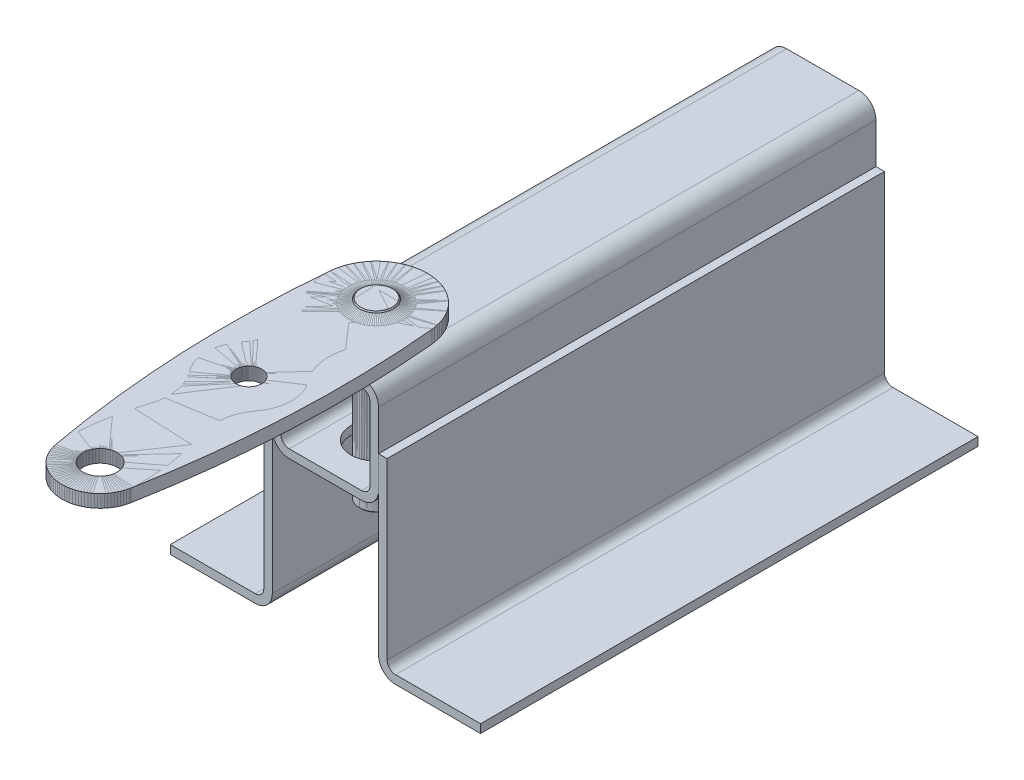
ISO-10303-21;
HEADER;
FILE_DESCRIPTION(('STEP AP214'),'2;1');
FILE_NAME('part.step','',(''),(''),'','','');
FILE_SCHEMA(('AUTOMOTIVE_DESIGN { 1 0 10303 214 1 1 1 1 }'));
ENDSEC;
DATA;
#1=APPLICATION_CONTEXT('core data for automotive mechanical design processes');
#2=APPLICATION_PROTOCOL_DEFINITION('international standard','automotive_design',2000,#1);
#3=PRODUCT_CONTEXT('',#1,'mechanical');
#4=PRODUCT('Part','Part','',(#3));
#5=PRODUCT_RELATED_PRODUCT_CATEGORY('part','',(#4));
#6=PRODUCT_DEFINITION_FORMATION('','',#4);
#7=PRODUCT_DEFINITION_CONTEXT('part definition',#1,'design');
#8=PRODUCT_DEFINITION('design','',#6,#7);
#9=PRODUCT_DEFINITION_SHAPE('','',#8);
#10=(LENGTH_UNIT() NAMED_UNIT(*) SI_UNIT(.MILLI.,.METRE.));
#11=(NAMED_UNIT(*) PLANE_ANGLE_UNIT() SI_UNIT($,.RADIAN.));
#12=(NAMED_UNIT(*) SI_UNIT($,.STERADIAN.) SOLID_ANGLE_UNIT());
#13=UNCERTAINTY_MEASURE_WITH_UNIT(LENGTH_MEASURE(1.E-05),#10,'distance_accuracy_value','');
#14=(GEOMETRIC_REPRESENTATION_CONTEXT(3) GLOBAL_UNCERTAINTY_ASSIGNED_CONTEXT((#13)) GLOBAL_UNIT_ASSIGNED_CONTEXT((#10,
#11,#12)) REPRESENTATION_CONTEXT('',''));
#15=CARTESIAN_POINT('',(0.,0.,0.));
#16=DIRECTION('',(0.,0.,1.));
#17=DIRECTION('',(1.,0.,0.));
#18=AXIS2_PLACEMENT_3D('',#15,#16,#17);
#19=CARTESIAN_POINT('',(0.,18.5,-12.));
#20=DIRECTION('',(0.,1.,0.));
#21=DIRECTION('',(0.,0.,1.));
#22=AXIS2_PLACEMENT_3D('',#19,#20,#21);
#23=CYLINDRICAL_SURFACE('',#22,4.);
#24=CARTESIAN_POINT('',(0.,-22.25,-12.));
#25=DIRECTION('',(0.,-1.,0.));
#26=DIRECTION('',(0.,0.,1.));
#27=AXIS2_PLACEMENT_3D('',#24,#25,#26);
#28=CIRCLE('',#27,4.);
#29=CARTESIAN_POINT('',(0.,-22.25,-8.));
#30=VERTEX_POINT('',#29);
#31=EDGE_CURVE('E193',#30,#30,#28,.T.);
#32=ORIENTED_EDGE('',*,*,#31,.F.);
#33=EDGE_LOOP('',(#32));
#34=FACE_BOUND('',#33,.T.);
#35=CARTESIAN_POINT('',(0.,14.5,-12.));
#36=DIRECTION('',(0.,-1.,0.));
#37=DIRECTION('',(1.,0.,0.));
#38=AXIS2_PLACEMENT_3D('',#35,#36,#37);
#39=CIRCLE('',#38,4.);
#40=CARTESIAN_POINT('',(4.,14.5,-12.));
#41=VERTEX_POINT('',#40);
#42=EDGE_CURVE('E396',#41,#41,#39,.T.);
#43=ORIENTED_EDGE('',*,*,#42,.T.);
#44=EDGE_LOOP('',(#43));
#45=FACE_BOUND('',#44,.T.);
#46=ADVANCED_FACE('F48',(#34,#45),#23,.T.);
#47=CARTESIAN_POINT('',(0.,-22.25,-12.));
#48=DIRECTION('',(0.,1.,0.));
#49=DIRECTION('',(0.,0.,1.));
#50=AXIS2_PLACEMENT_3D('',#47,#48,#49);
#51=CONICAL_SURFACE('',#50,4.,0.785398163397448);
#52=CARTESIAN_POINT('',(0.,-22.5,-12.));
#53=DIRECTION('',(0.,-1.,0.));
#54=DIRECTION('',(0.,0.,1.));
#55=AXIS2_PLACEMENT_3D('',#52,#53,#54);
#56=CIRCLE('',#55,3.75);
#57=CARTESIAN_POINT('',(0.,-22.5,-8.25));
#58=VERTEX_POINT('',#57);
#59=EDGE_CURVE('E190',#58,#58,#56,.T.);
#60=ORIENTED_EDGE('',*,*,#59,.F.);
#61=EDGE_LOOP('',(#60));
#62=FACE_BOUND('',#61,.T.);
#63=ORIENTED_EDGE('',*,*,#31,.T.);
#64=EDGE_LOOP('',(#63));
#65=FACE_BOUND('',#64,.T.);
#66=ADVANCED_FACE('F218',(#62,#65),#51,.T.);
#67=CARTESIAN_POINT('',(0.,-22.5,-8.575));
#68=DIRECTION('',(0.,-1.,0.));
#69=DIRECTION('',(0.,0.,-1.));
#70=AXIS2_PLACEMENT_3D('',#67,#68,#69);
#71=PLANE('',#70);
#72=CARTESIAN_POINT('',(0.,-22.5,-12.));
#73=DIRECTION('',(0.,-1.,0.));
#74=DIRECTION('',(0.,0.,1.));
#75=AXIS2_PLACEMENT_3D('',#72,#73,#74);
#76=CIRCLE('',#75,3.425);
#77=CARTESIAN_POINT('',(0.,-22.5,-8.57500000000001));
#78=VERTEX_POINT('',#77);
#79=EDGE_CURVE('E187',#78,#78,#76,.T.);
#80=ORIENTED_EDGE('',*,*,#79,.F.);
#81=EDGE_LOOP('',(#80));
#82=FACE_BOUND('',#81,.T.);
#83=ORIENTED_EDGE('',*,*,#59,.T.);
#84=EDGE_LOOP('',(#83));
#85=FACE_BOUND('',#84,.T.);
#86=ADVANCED_FACE('F224',(#82,#85),#71,.T.);
#87=CARTESIAN_POINT('',(0.,-22.5,-12.));
#88=DIRECTION('',(0.,-1.,0.));
#89=DIRECTION('',(0.,0.,-1.));
#90=AXIS2_PLACEMENT_3D('',#87,#88,#89);
#91=CONICAL_SURFACE('',#90,3.425,0.785398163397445);
#92=CARTESIAN_POINT('',(0.,-22.25,-12.));
#93=DIRECTION('',(0.,-1.,0.));
#94=DIRECTION('',(0.,0.,1.));
#95=AXIS2_PLACEMENT_3D('',#92,#93,#94);
#96=CIRCLE('',#95,3.175);
#97=CARTESIAN_POINT('',(0.,-22.25,-8.825));
#98=VERTEX_POINT('',#97);
#99=EDGE_CURVE('E184',#98,#98,#96,.T.);
#100=ORIENTED_EDGE('',*,*,#99,.F.);
#101=EDGE_LOOP('',(#100));
#102=FACE_BOUND('',#101,.T.);
#103=ORIENTED_EDGE('',*,*,#79,.T.);
#104=EDGE_LOOP('',(#103));
#105=FACE_BOUND('',#104,.T.);
#106=ADVANCED_FACE('F232',(#102,#105),#91,.F.);
#107=CARTESIAN_POINT('',(0.,18.5,-12.));
#108=DIRECTION('',(0.,1.,0.));
#109=DIRECTION('',(0.,0.,1.));
#110=AXIS2_PLACEMENT_3D('',#107,#108,#109);
#111=CYLINDRICAL_SURFACE('',#110,3.175);
#112=CARTESIAN_POINT('',(0.,-10.333087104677,-12.));
#113=DIRECTION('',(0.,-1.,0.));
#114=DIRECTION('',(0.,0.,1.));
#115=AXIS2_PLACEMENT_3D('',#112,#113,#114);
#116=CIRCLE('',#115,3.175);
#117=CARTESIAN_POINT('',(0.,-10.333087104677,-8.825));
#118=VERTEX_POINT('',#117);
#119=EDGE_CURVE('E181',#118,#118,#116,.T.);
#120=ORIENTED_EDGE('',*,*,#119,.F.);
#121=EDGE_LOOP('',(#120));
#122=FACE_BOUND('',#121,.T.);
#123=ORIENTED_EDGE('',*,*,#99,.T.);
#124=EDGE_LOOP('',(#123));
#125=FACE_BOUND('',#124,.T.);
#126=ADVANCED_FACE('F236',(#122,#125),#111,.F.);
#127=CARTESIAN_POINT('',(0.,-10.333087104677,-12.));
#128=DIRECTION('',(0.,-1.,0.));
#129=DIRECTION('',(0.,0.,-1.));
#130=AXIS2_PLACEMENT_3D('',#127,#128,#129);
#131=CONICAL_SURFACE('',#130,3.175,1.0471975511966);
#132=CARTESIAN_POINT('',(0.,-8.49999999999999,-12.));
#133=VERTEX_POINT('',#132);
#134=VERTEX_LOOP('',#133);
#135=FACE_BOUND('',#134,.T.);
#136=ORIENTED_EDGE('',*,*,#119,.T.);
#137=EDGE_LOOP('',(#136));
#138=FACE_BOUND('',#137,.T.);
#139=ADVANCED_FACE('F212',(#135,#138),#131,.F.);
#140=CARTESIAN_POINT('',(15.1599704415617,14.5,42.1661458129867));
#141=DIRECTION('',(0.,1.,0.));
#142=DIRECTION('',(1.,0.,0.));
#143=AXIS2_PLACEMENT_3D('',#140,#141,#142);
#144=PLANE('',#143);
#145=CARTESIAN_POINT('',(0.,14.5,53.));
#146=DIRECTION('',(0.,-1.,0.));
#147=DIRECTION('',(1.,0.,0.));
#148=AXIS2_PLACEMENT_3D('',#145,#146,#147);
#149=CIRCLE('',#148,4.);
#150=CARTESIAN_POINT('',(4.,14.5,53.));
#151=VERTEX_POINT('',#150);
#152=EDGE_CURVE('E136',#151,#151,#149,.T.);
#153=ORIENTED_EDGE('',*,*,#152,.F.);
#154=EDGE_LOOP('',(#153));
#155=FACE_BOUND('',#154,.T.);
#156=CARTESIAN_POINT('',(47.8199408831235,14.5,53.));
#157=DIRECTION('',(0.,-1.,0.));
#158=DIRECTION('',(1.,0.,0.));
#159=AXIS2_PLACEMENT_3D('',#156,#157,#158);
#160=CIRCLE('',#159,56.8199408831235);
#161=CARTESIAN_POINT('',(-9.00000000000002,14.5,53.));
#162=VERTEX_POINT('',#161);
#163=CARTESIAN_POINT('',(-6.11028823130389,14.5,35.1104480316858));
#164=VERTEX_POINT('',#163);
#165=EDGE_CURVE('E113',#162,#164,#160,.T.);
#166=ORIENTED_EDGE('',*,*,#165,.T.);
#167=CARTESIAN_POINT('',(-17.5,14.5,31.3322916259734));
#168=DIRECTION('',(0.,1.,0.));
#169=DIRECTION('',(1.,0.,0.));
#170=AXIS2_PLACEMENT_3D('',#167,#168,#169);
#171=CIRCLE('',#170,12.);
#172=CARTESIAN_POINT('',(-7.95454545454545,14.5,24.0601325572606));
#173=VERTEX_POINT('',#172);
#174=EDGE_CURVE('E121',#164,#173,#171,.T.);
#175=ORIENTED_EDGE('',*,*,#174,.T.);
#176=CARTESIAN_POINT('',(0.,14.5,18.));
#177=DIRECTION('',(0.,-1.,0.));
#178=DIRECTION('',(1.,0.,0.));
#179=AXIS2_PLACEMENT_3D('',#176,#177,#178);
#180=CIRCLE('',#179,10.);
#181=CARTESIAN_POINT('',(-7.90763948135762,14.5,11.8787878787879));
#182=VERTEX_POINT('',#181);
#183=EDGE_CURVE('E127',#173,#182,#180,.T.);
#184=ORIENTED_EDGE('',*,*,#183,.T.);
#185=CARTESIAN_POINT('',(-17.3968068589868,14.5,4.53333333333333));
#186=DIRECTION('',(0.,1.,0.));
#187=DIRECTION('',(1.,0.,0.));
#188=AXIS2_PLACEMENT_3D('',#185,#186,#187);
#189=CIRCLE('',#188,12.);
#190=CARTESIAN_POINT('',(-8.69840342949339,14.5,-3.73333333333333));
#191=VERTEX_POINT('',#190);
#192=EDGE_CURVE('E141',#182,#191,#189,.T.);
#193=ORIENTED_EDGE('',*,*,#192,.T.);
#194=CARTESIAN_POINT('',(0.,14.5,-12.));
#195=DIRECTION('',(0.,-1.,0.));
#196=DIRECTION('',(1.,0.,0.));
#197=AXIS2_PLACEMENT_3D('',#194,#195,#196);
#198=CIRCLE('',#197,12.);
#199=CARTESIAN_POINT('',(11.951181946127,14.5,-13.0813186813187));
#200=VERTEX_POINT('',#199);
#201=EDGE_CURVE('E144',#191,#200,#198,.T.);
#202=ORIENTED_EDGE('',*,*,#201,.T.);
#203=CARTESIAN_POINT('',(-237.031775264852,14.5,9.44615384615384));
#204=DIRECTION('',(0.,-1.,0.));
#205=DIRECTION('',(1.,0.,0.));
#206=AXIS2_PLACEMENT_3D('',#203,#204,#205);
#207=CIRCLE('',#206,250.);
#208=CARTESIAN_POINT('',(8.85180903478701,14.5,54.6264921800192));
#209=VERTEX_POINT('',#208);
#210=EDGE_CURVE('E147',#200,#209,#207,.T.);
#211=ORIENTED_EDGE('',*,*,#210,.T.);
#212=CARTESIAN_POINT('',(0.,14.5,53.));
#213=DIRECTION('',(0.,-1.,0.));
#214=DIRECTION('',(1.,0.,0.));
#215=AXIS2_PLACEMENT_3D('',#212,#213,#214);
#216=CIRCLE('',#215,9.00000000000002);
#217=EDGE_CURVE('E132',#209,#162,#216,.T.);
#218=ORIENTED_EDGE('',*,*,#217,.T.);
#219=EDGE_LOOP('',(#166,#175,#184,#193,#202,#211,#218));
#220=FACE_BOUND('',#219,.T.);
#221=CARTESIAN_POINT('',(0.,14.5,18.));
#222=DIRECTION('',(0.,-1.,0.));
#223=DIRECTION('',(1.,0.,0.));
#224=AXIS2_PLACEMENT_3D('',#221,#222,#223);
#225=CIRCLE('',#224,3.);
#226=CARTESIAN_POINT('',(3.,14.5,18.));
#227=VERTEX_POINT('',#226);
#228=EDGE_CURVE('E133',#227,#227,#225,.T.);
#229=ORIENTED_EDGE('',*,*,#228,.F.);
#230=EDGE_LOOP('',(#229));
#231=FACE_BOUND('',#230,.T.);
#232=ORIENTED_EDGE('',*,*,#42,.F.);
#233=EDGE_LOOP('',(#232));
#234=FACE_BOUND('',#233,.T.);
#235=ADVANCED_FACE('F129',(#155,#220,#231,#234),#144,.F.);
#236=CARTESIAN_POINT('',(0.,18.5,-8.25));
#237=DIRECTION('',(0.,1.,0.));
#238=DIRECTION('',(0.,0.,1.));
#239=AXIS2_PLACEMENT_3D('',#236,#237,#238);
#240=PLANE('',#239);
#241=CARTESIAN_POINT('',(0.,18.5,-12.));
#242=DIRECTION('',(0.,-1.,0.));
#243=DIRECTION('',(0.,0.,1.));
#244=AXIS2_PLACEMENT_3D('',#241,#242,#243);
#245=CIRCLE('',#244,3.75);
#246=CARTESIAN_POINT('',(0.,18.5,-8.25));
#247=VERTEX_POINT('',#246);
#248=EDGE_CURVE('E117',#247,#247,#245,.T.);
#249=ORIENTED_EDGE('',*,*,#248,.F.);
#250=EDGE_LOOP('',(#249));
#251=FACE_BOUND('',#250,.T.);
#252=ADVANCED_FACE('F204',(#251),#240,.T.);
#253=CARTESIAN_POINT('',(0.,18.5,-12.));
#254=DIRECTION('',(0.,-1.,0.));
#255=DIRECTION('',(0.,0.,-1.));
#256=AXIS2_PLACEMENT_3D('',#253,#254,#255);
#257=CONICAL_SURFACE('',#256,3.75,0.785398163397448);
#258=CARTESIAN_POINT('',(0.,18.25,-12.));
#259=DIRECTION('',(0.,-1.,0.));
#260=DIRECTION('',(0.,0.,1.));
#261=AXIS2_PLACEMENT_3D('',#258,#259,#260);
#262=CIRCLE('',#261,4.);
#263=CARTESIAN_POINT('',(0.,18.25,-8.));
#264=VERTEX_POINT('',#263);
#265=EDGE_CURVE('E56',#264,#264,#262,.T.);
#266=ORIENTED_EDGE('',*,*,#265,.F.);
#267=EDGE_LOOP('',(#266));
#268=FACE_BOUND('',#267,.T.);
#269=ORIENTED_EDGE('',*,*,#248,.T.);
#270=EDGE_LOOP('',(#269));
#271=FACE_BOUND('',#270,.T.);
#272=ADVANCED_FACE('F200',(#268,#271),#257,.T.);
#273=CARTESIAN_POINT('',(0.,17.5,18.));
#274=DIRECTION('',(0.,-1.,0.));
#275=DIRECTION('',(-1.,0.,0.));
#276=AXIS2_PLACEMENT_3D('',#273,#274,#275);
#277=CYLINDRICAL_SURFACE('',#276,3.);
#278=ORIENTED_EDGE('',*,*,#228,.T.);
#279=EDGE_LOOP('',(#278));
#280=FACE_BOUND('',#279,.T.);
#281=CARTESIAN_POINT('',(0.,17.5,18.));
#282=DIRECTION('',(0.,-1.,0.));
#283=DIRECTION('',(1.,0.,0.));
#284=AXIS2_PLACEMENT_3D('',#281,#282,#283);
#285=CIRCLE('',#284,3.);
#286=CARTESIAN_POINT('',(3.,17.5,18.));
#287=VERTEX_POINT('',#286);
#288=EDGE_CURVE('E153',#287,#287,#285,.T.);
#289=ORIENTED_EDGE('',*,*,#288,.F.);
#290=EDGE_LOOP('',(#289));
#291=FACE_BOUND('',#290,.T.);
#292=ADVANCED_FACE('F203',(#280,#291),#277,.F.);
#293=CARTESIAN_POINT('',(0.,17.5,53.));
#294=DIRECTION('',(0.,-1.,0.));
#295=DIRECTION('',(-1.,0.,0.));
#296=AXIS2_PLACEMENT_3D('',#293,#294,#295);
#297=CYLINDRICAL_SURFACE('',#296,9.00000000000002);
#298=DIRECTION('',(0.,-1.,0.));
#299=VECTOR('',#298,1.);
#300=CARTESIAN_POINT('',(8.85180903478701,17.5,54.6264921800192));
#301=LINE('',#300,#299);
#302=CARTESIAN_POINT('',(8.85180903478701,17.5,54.6264921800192));
#303=VERTEX_POINT('',#302);
#304=EDGE_CURVE('E170',#303,#209,#301,.T.);
#305=ORIENTED_EDGE('',*,*,#304,.F.);
#306=CARTESIAN_POINT('',(0.,17.5,53.));
#307=DIRECTION('',(0.,-1.,0.));
#308=DIRECTION('',(1.,0.,0.));
#309=AXIS2_PLACEMENT_3D('',#306,#307,#308);
#310=CIRCLE('',#309,9.00000000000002);
#311=CARTESIAN_POINT('',(-9.00000000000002,17.5,53.));
#312=VERTEX_POINT('',#311);
#313=EDGE_CURVE('E167',#303,#312,#310,.T.);
#314=ORIENTED_EDGE('',*,*,#313,.T.);
#315=DIRECTION('',(0.,-1.,0.));
#316=VECTOR('',#315,1.);
#317=CARTESIAN_POINT('',(-9.00000000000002,17.5,53.));
#318=LINE('',#317,#316);
#319=EDGE_CURVE('E63',#312,#162,#318,.T.);
#320=ORIENTED_EDGE('',*,*,#319,.T.);
#321=ORIENTED_EDGE('',*,*,#217,.F.);
#322=EDGE_LOOP('',(#305,#314,#320,#321));
#323=FACE_BOUND('',#322,.T.);
#324=ADVANCED_FACE('F280',(#323),#297,.T.);
#325=CARTESIAN_POINT('',(-237.031775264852,17.5,9.44615384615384));
#326=DIRECTION('',(0.,-1.,0.));
#327=DIRECTION('',(-1.,0.,0.));
#328=AXIS2_PLACEMENT_3D('',#325,#326,#327);
#329=CYLINDRICAL_SURFACE('',#328,250.);
#330=DIRECTION('',(0.,-1.,0.));
#331=VECTOR('',#330,1.);
#332=CARTESIAN_POINT('',(11.951181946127,17.5,-13.0813186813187));
#333=LINE('',#332,#331);
#334=CARTESIAN_POINT('',(11.951181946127,17.5,-13.0813186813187));
#335=VERTEX_POINT('',#334);
#336=EDGE_CURVE('E172',#335,#200,#333,.T.);
#337=ORIENTED_EDGE('',*,*,#336,.F.);
#338=CARTESIAN_POINT('',(-237.031775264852,17.5,9.44615384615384));
#339=DIRECTION('',(0.,-1.,0.));
#340=DIRECTION('',(1.,0.,0.));
#341=AXIS2_PLACEMENT_3D('',#338,#339,#340);
#342=CIRCLE('',#341,250.);
#343=EDGE_CURVE('E165',#335,#303,#342,.T.);
#344=ORIENTED_EDGE('',*,*,#343,.T.);
#345=ORIENTED_EDGE('',*,*,#304,.T.);
#346=ORIENTED_EDGE('',*,*,#210,.F.);
#347=EDGE_LOOP('',(#337,#344,#345,#346));
#348=FACE_BOUND('',#347,.T.);
#349=ADVANCED_FACE('F290',(#348),#329,.T.);
#350=CARTESIAN_POINT('',(0.,17.5,-12.));
#351=DIRECTION('',(0.,-1.,0.));
#352=DIRECTION('',(-1.,0.,0.));
#353=AXIS2_PLACEMENT_3D('',#350,#351,#352);
#354=CYLINDRICAL_SURFACE('',#353,12.);
#355=DIRECTION('',(0.,-1.,0.));
#356=VECTOR('',#355,1.);
#357=CARTESIAN_POINT('',(-8.69840342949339,17.5,-3.73333333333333));
#358=LINE('',#357,#356);
#359=CARTESIAN_POINT('',(-8.69840342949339,17.5,-3.73333333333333));
#360=VERTEX_POINT('',#359);
#361=EDGE_CURVE('E174',#360,#191,#358,.T.);
#362=ORIENTED_EDGE('',*,*,#361,.F.);
#363=CARTESIAN_POINT('',(0.,17.5,-12.));
#364=DIRECTION('',(0.,-1.,0.));
#365=DIRECTION('',(1.,0.,0.));
#366=AXIS2_PLACEMENT_3D('',#363,#364,#365);
#367=CIRCLE('',#366,12.);
#368=EDGE_CURVE('E163',#360,#335,#367,.T.);
#369=ORIENTED_EDGE('',*,*,#368,.T.);
#370=ORIENTED_EDGE('',*,*,#336,.T.);
#371=ORIENTED_EDGE('',*,*,#201,.F.);
#372=EDGE_LOOP('',(#362,#369,#370,#371));
#373=FACE_BOUND('',#372,.T.);
#374=ADVANCED_FACE('F299',(#373),#354,.T.);
#375=CARTESIAN_POINT('',(-17.3968068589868,17.5,4.53333333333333));
#376=DIRECTION('',(0.,-1.,0.));
#377=DIRECTION('',(-1.,0.,0.));
#378=AXIS2_PLACEMENT_3D('',#375,#376,#377);
#379=CYLINDRICAL_SURFACE('',#378,12.);
#380=DIRECTION('',(0.,-1.,0.));
#381=VECTOR('',#380,1.);
#382=CARTESIAN_POINT('',(-7.90763948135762,17.5,11.8787878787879));
#383=LINE('',#382,#381);
#384=CARTESIAN_POINT('',(-7.90763948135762,17.5,11.8787878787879));
#385=VERTEX_POINT('',#384);
#386=EDGE_CURVE('E176',#385,#182,#383,.T.);
#387=ORIENTED_EDGE('',*,*,#386,.F.);
#388=CARTESIAN_POINT('',(-17.3968068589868,17.5,4.53333333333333));
#389=DIRECTION('',(0.,1.,0.));
#390=DIRECTION('',(1.,0.,0.));
#391=AXIS2_PLACEMENT_3D('',#388,#389,#390);
#392=CIRCLE('',#391,12.);
#393=EDGE_CURVE('E161',#385,#360,#392,.T.);
#394=ORIENTED_EDGE('',*,*,#393,.T.);
#395=ORIENTED_EDGE('',*,*,#361,.T.);
#396=ORIENTED_EDGE('',*,*,#192,.F.);
#397=EDGE_LOOP('',(#387,#394,#395,#396));
#398=FACE_BOUND('',#397,.T.);
#399=ADVANCED_FACE('F309',(#398),#379,.F.);
#400=CARTESIAN_POINT('',(0.,17.5,18.));
#401=DIRECTION('',(0.,-1.,0.));
#402=DIRECTION('',(-1.,0.,0.));
#403=AXIS2_PLACEMENT_3D('',#400,#401,#402);
#404=CYLINDRICAL_SURFACE('',#403,10.);
#405=DIRECTION('',(0.,-1.,0.));
#406=VECTOR('',#405,1.);
#407=CARTESIAN_POINT('',(-7.95454545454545,17.5,24.0601325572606));
#408=LINE('',#407,#406);
#409=CARTESIAN_POINT('',(-7.95454545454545,17.5,24.0601325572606));
#410=VERTEX_POINT('',#409);
#411=EDGE_CURVE('E118',#410,#173,#408,.T.);
#412=ORIENTED_EDGE('',*,*,#411,.F.);
#413=CARTESIAN_POINT('',(0.,17.5,18.));
#414=DIRECTION('',(0.,-1.,0.));
#415=DIRECTION('',(1.,0.,0.));
#416=AXIS2_PLACEMENT_3D('',#413,#414,#415);
#417=CIRCLE('',#416,10.);
#418=EDGE_CURVE('E159',#410,#385,#417,.T.);
#419=ORIENTED_EDGE('',*,*,#418,.T.);
#420=ORIENTED_EDGE('',*,*,#386,.T.);
#421=ORIENTED_EDGE('',*,*,#183,.F.);
#422=EDGE_LOOP('',(#412,#419,#420,#421));
#423=FACE_BOUND('',#422,.T.);
#424=ADVANCED_FACE('F319',(#423),#404,.T.);
#425=CARTESIAN_POINT('',(-17.5,17.5,31.3322916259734));
#426=DIRECTION('',(0.,-1.,0.));
#427=DIRECTION('',(-1.,0.,0.));
#428=AXIS2_PLACEMENT_3D('',#425,#426,#427);
#429=CYLINDRICAL_SURFACE('',#428,12.);
#430=DIRECTION('',(0.,-1.,0.));
#431=VECTOR('',#430,1.);
#432=CARTESIAN_POINT('',(-6.11028823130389,17.5,35.1104480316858));
#433=LINE('',#432,#431);
#434=CARTESIAN_POINT('',(-6.11028823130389,17.5,35.1104480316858));
#435=VERTEX_POINT('',#434);
#436=EDGE_CURVE('E109',#435,#164,#433,.T.);
#437=ORIENTED_EDGE('',*,*,#436,.F.);
#438=CARTESIAN_POINT('',(-17.5,17.5,31.3322916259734));
#439=DIRECTION('',(0.,1.,0.));
#440=DIRECTION('',(1.,0.,0.));
#441=AXIS2_PLACEMENT_3D('',#438,#439,#440);
#442=CIRCLE('',#441,12.);
#443=EDGE_CURVE('E157',#435,#410,#442,.T.);
#444=ORIENTED_EDGE('',*,*,#443,.T.);
#445=ORIENTED_EDGE('',*,*,#411,.T.);
#446=ORIENTED_EDGE('',*,*,#174,.F.);
#447=EDGE_LOOP('',(#437,#444,#445,#446));
#448=FACE_BOUND('',#447,.T.);
#449=ADVANCED_FACE('F122',(#448),#429,.F.);
#450=CARTESIAN_POINT('',(47.8199408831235,17.5,53.));
#451=DIRECTION('',(0.,-1.,0.));
#452=DIRECTION('',(-1.,0.,0.));
#453=AXIS2_PLACEMENT_3D('',#450,#451,#452);
#454=CYLINDRICAL_SURFACE('',#453,56.8199408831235);
#455=ORIENTED_EDGE('',*,*,#319,.F.);
#456=CARTESIAN_POINT('',(47.8199408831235,17.5,53.));
#457=DIRECTION('',(0.,-1.,0.));
#458=DIRECTION('',(1.,0.,0.));
#459=AXIS2_PLACEMENT_3D('',#456,#457,#458);
#460=CIRCLE('',#459,56.8199408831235);
#461=EDGE_CURVE('E114',#312,#435,#460,.T.);
#462=ORIENTED_EDGE('',*,*,#461,.T.);
#463=ORIENTED_EDGE('',*,*,#436,.T.);
#464=ORIENTED_EDGE('',*,*,#165,.F.);
#465=EDGE_LOOP('',(#455,#462,#463,#464));
#466=FACE_BOUND('',#465,.T.);
#467=ADVANCED_FACE('F111',(#466),#454,.T.);
#468=CARTESIAN_POINT('',(15.1599704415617,17.5,42.1661458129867));
#469=DIRECTION('',(0.,1.,0.));
#470=DIRECTION('',(1.,0.,0.));
#471=AXIS2_PLACEMENT_3D('',#468,#469,#470);
#472=PLANE('',#471);
#473=CARTESIAN_POINT('',(0.,17.5,-12.));
#474=DIRECTION('',(0.,-1.,0.));
#475=DIRECTION('',(1.,0.,0.));
#476=AXIS2_PLACEMENT_3D('',#473,#474,#475);
#477=CIRCLE('',#476,6.63391343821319);
#478=CARTESIAN_POINT('',(6.63391343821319,17.5,-12.));
#479=VERTEX_POINT('',#478);
#480=EDGE_CURVE('E12',#479,#479,#477,.F.);
#481=ORIENTED_EDGE('',*,*,#480,.F.);
#482=EDGE_LOOP('',(#481));
#483=FACE_BOUND('',#482,.T.);
#484=CARTESIAN_POINT('',(0.,17.5,53.));
#485=DIRECTION('',(0.,-1.,0.));
#486=DIRECTION('',(1.,0.,0.));
#487=AXIS2_PLACEMENT_3D('',#484,#485,#486);
#488=CIRCLE('',#487,4.);
#489=CARTESIAN_POINT('',(4.,17.5,53.));
#490=VERTEX_POINT('',#489);
#491=EDGE_CURVE('E150',#490,#490,#488,.T.);
#492=ORIENTED_EDGE('',*,*,#491,.T.);
#493=EDGE_LOOP('',(#492));
#494=FACE_BOUND('',#493,.T.);
#495=ORIENTED_EDGE('',*,*,#461,.F.);
#496=ORIENTED_EDGE('',*,*,#313,.F.);
#497=ORIENTED_EDGE('',*,*,#343,.F.);
#498=ORIENTED_EDGE('',*,*,#368,.F.);
#499=ORIENTED_EDGE('',*,*,#393,.F.);
#500=ORIENTED_EDGE('',*,*,#418,.F.);
#501=ORIENTED_EDGE('',*,*,#443,.F.);
#502=EDGE_LOOP('',(#495,#496,#497,#498,#499,#500,#501));
#503=FACE_BOUND('',#502,.T.);
#504=ORIENTED_EDGE('',*,*,#288,.T.);
#505=EDGE_LOOP('',(#504));
#506=FACE_BOUND('',#505,.T.);
#507=ADVANCED_FACE('F346',(#483,#494,#503,#506),#472,.T.);
#508=CARTESIAN_POINT('',(0.,17.5,53.));
#509=DIRECTION('',(0.,-1.,0.));
#510=DIRECTION('',(-1.,0.,0.));
#511=AXIS2_PLACEMENT_3D('',#508,#509,#510);
#512=CYLINDRICAL_SURFACE('',#511,4.);
#513=ORIENTED_EDGE('',*,*,#152,.T.);
#514=EDGE_LOOP('',(#513));
#515=FACE_BOUND('',#514,.T.);
#516=ORIENTED_EDGE('',*,*,#491,.F.);
#517=EDGE_LOOP('',(#516));
#518=FACE_BOUND('',#517,.T.);
#519=ADVANCED_FACE('F354',(#515,#518),#512,.F.);
#520=CARTESIAN_POINT('',(0.,22.5,-12.));
#521=DIRECTION('',(0.,1.,0.));
#522=DIRECTION('',(1.,0.,0.));
#523=AXIS2_PLACEMENT_3D('',#520,#521,#522);
#524=TOROIDAL_SURFACE('',#523,6.63391343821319,5.);
#525=ORIENTED_EDGE('',*,*,#265,.T.);
#526=EDGE_LOOP('',(#525));
#527=FACE_BOUND('',#526,.T.);
#528=ORIENTED_EDGE('',*,*,#480,.T.);
#529=EDGE_LOOP('',(#528));
#530=FACE_BOUND('',#529,.T.);
#531=ADVANCED_FACE('F50',(#527,#530),#524,.F.);
#532=CLOSED_SHELL('',(#46,#66,#86,#106,#126,#139,#235,#252,#272,#292,#324,#349,#374,#399,#424,
#449,#467,#507,#519,#531));
#533=MANIFOLD_SOLID_BREP('B2',#532);
#534=CARTESIAN_POINT('',(0.,18.5,-12.));
#535=DIRECTION('',(0.,1.,0.));
#536=DIRECTION('',(0.,0.,1.));
#537=AXIS2_PLACEMENT_3D('',#534,#535,#536);
#538=CYLINDRICAL_SURFACE('',#537,4.);
#539=CARTESIAN_POINT('',(0.,-22.25,-12.));
#540=DIRECTION('',(0.,1.,0.));
#541=DIRECTION('',(0.,0.,1.));
#542=AXIS2_PLACEMENT_3D('',#539,#540,#541);
#543=CIRCLE('',#542,4.);
#544=CARTESIAN_POINT('',(0.,-22.25,-8.));
#545=VERTEX_POINT('',#544);
#546=EDGE_CURVE('E557',#545,#545,#543,.T.);
#547=ORIENTED_EDGE('',*,*,#546,.T.);
#548=EDGE_LOOP('',(#547));
#549=FACE_BOUND('',#548,.T.);
#550=CARTESIAN_POINT('',(0.,14.5,-12.));
#551=DIRECTION('',(0.,1.,0.));
#552=DIRECTION('',(-1.,0.,0.));
#553=AXIS2_PLACEMENT_3D('',#550,#551,#552);
#554=CIRCLE('',#553,4.);
#555=CARTESIAN_POINT('',(-4.,14.5,-12.));
#556=VERTEX_POINT('',#555);
#557=EDGE_CURVE('E837',#556,#556,#554,.T.);
#558=ORIENTED_EDGE('',*,*,#557,.F.);
#559=EDGE_LOOP('',(#558));
#560=FACE_BOUND('',#559,.T.);
#561=ADVANCED_FACE('F456',(#549,#560),#538,.T.);
#562=CARTESIAN_POINT('',(0.,-22.25,-12.));
#563=DIRECTION('',(0.,1.,0.));
#564=DIRECTION('',(0.,0.,1.));
#565=AXIS2_PLACEMENT_3D('',#562,#563,#564);
#566=CONICAL_SURFACE('',#565,4.,0.785398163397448);
#567=CARTESIAN_POINT('',(0.,-22.5,-12.));
#568=DIRECTION('',(0.,1.,0.));
#569=DIRECTION('',(0.,0.,1.));
#570=AXIS2_PLACEMENT_3D('',#567,#568,#569);
#571=CIRCLE('',#570,3.75);
#572=CARTESIAN_POINT('',(0.,-22.5,-8.25));
#573=VERTEX_POINT('',#572);
#574=EDGE_CURVE('E554',#573,#573,#571,.T.);
#575=ORIENTED_EDGE('',*,*,#574,.T.);
#576=EDGE_LOOP('',(#575));
#577=FACE_BOUND('',#576,.T.);
#578=ORIENTED_EDGE('',*,*,#546,.F.);
#579=EDGE_LOOP('',(#578));
#580=FACE_BOUND('',#579,.T.);
#581=ADVANCED_FACE('F649',(#577,#580),#566,.T.);
#582=CARTESIAN_POINT('',(0.,-22.5,-8.575));
#583=DIRECTION('',(0.,-1.,0.));
#584=DIRECTION('',(0.,0.,-1.));
#585=AXIS2_PLACEMENT_3D('',#582,#583,#584);
#586=PLANE('',#585);
#587=CARTESIAN_POINT('',(0.,-22.5,-12.));
#588=DIRECTION('',(0.,1.,0.));
#589=DIRECTION('',(0.,0.,1.));
#590=AXIS2_PLACEMENT_3D('',#587,#588,#589);
#591=CIRCLE('',#590,3.425);
#592=CARTESIAN_POINT('',(0.,-22.5,-8.57500000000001));
#593=VERTEX_POINT('',#592);
#594=EDGE_CURVE('E551',#593,#593,#591,.T.);
#595=ORIENTED_EDGE('',*,*,#594,.T.);
#596=EDGE_LOOP('',(#595));
#597=FACE_BOUND('',#596,.T.);
#598=ORIENTED_EDGE('',*,*,#574,.F.);
#599=EDGE_LOOP('',(#598));
#600=FACE_BOUND('',#599,.T.);
#601=ADVANCED_FACE('F655',(#597,#600),#586,.T.);
#602=CARTESIAN_POINT('',(0.,-22.5,-12.));
#603=DIRECTION('',(0.,-1.,0.));
#604=DIRECTION('',(0.,0.,-1.));
#605=AXIS2_PLACEMENT_3D('',#602,#603,#604);
#606=CONICAL_SURFACE('',#605,3.425,0.785398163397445);
#607=CARTESIAN_POINT('',(0.,-22.25,-12.));
#608=DIRECTION('',(0.,1.,0.));
#609=DIRECTION('',(0.,0.,1.));
#610=AXIS2_PLACEMENT_3D('',#607,#608,#609);
#611=CIRCLE('',#610,3.175);
#612=CARTESIAN_POINT('',(0.,-22.25,-8.825));
#613=VERTEX_POINT('',#612);
#614=EDGE_CURVE('E548',#613,#613,#611,.T.);
#615=ORIENTED_EDGE('',*,*,#614,.T.);
#616=EDGE_LOOP('',(#615));
#617=FACE_BOUND('',#616,.T.);
#618=ORIENTED_EDGE('',*,*,#594,.F.);
#619=EDGE_LOOP('',(#618));
#620=FACE_BOUND('',#619,.T.);
#621=ADVANCED_FACE('F685',(#617,#620),#606,.F.);
#622=CARTESIAN_POINT('',(0.,18.5,-12.));
#623=DIRECTION('',(0.,1.,0.));
#624=DIRECTION('',(0.,0.,1.));
#625=AXIS2_PLACEMENT_3D('',#622,#623,#624);
#626=CYLINDRICAL_SURFACE('',#625,3.175);
#627=CARTESIAN_POINT('',(0.,-10.333087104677,-12.));
#628=DIRECTION('',(0.,1.,0.));
#629=DIRECTION('',(0.,0.,1.));
#630=AXIS2_PLACEMENT_3D('',#627,#628,#629);
#631=CIRCLE('',#630,3.175);
#632=CARTESIAN_POINT('',(0.,-10.333087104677,-8.825));
#633=VERTEX_POINT('',#632);
#634=EDGE_CURVE('E540',#633,#633,#631,.T.);
#635=ORIENTED_EDGE('',*,*,#634,.T.);
#636=EDGE_LOOP('',(#635));
#637=FACE_BOUND('',#636,.T.);
#638=ORIENTED_EDGE('',*,*,#614,.F.);
#639=EDGE_LOOP('',(#638));
#640=FACE_BOUND('',#639,.T.);
#641=ADVANCED_FACE('F682',(#637,#640),#626,.F.);
#642=CARTESIAN_POINT('',(0.,-10.333087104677,-12.));
#643=DIRECTION('',(0.,-1.,0.));
#644=DIRECTION('',(0.,0.,-1.));
#645=AXIS2_PLACEMENT_3D('',#642,#643,#644);
#646=CONICAL_SURFACE('',#645,3.175,1.0471975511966);
#647=CARTESIAN_POINT('',(0.,-8.49999999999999,-12.));
#648=VERTEX_POINT('',#647);
#649=VERTEX_LOOP('',#648);
#650=FACE_BOUND('',#649,.T.);
#651=ORIENTED_EDGE('',*,*,#634,.F.);
#652=EDGE_LOOP('',(#651));
#653=FACE_BOUND('',#652,.T.);
#654=ADVANCED_FACE('F674',(#650,#653),#646,.F.);
#655=CARTESIAN_POINT('',(-15.1599704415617,14.5,42.1661458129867));
#656=DIRECTION('',(0.,1.,0.));
#657=DIRECTION('',(-1.,0.,0.));
#658=AXIS2_PLACEMENT_3D('',#655,#656,#657);
#659=PLANE('',#658);
#660=CARTESIAN_POINT('',(0.,14.5,53.));
#661=DIRECTION('',(0.,1.,0.));
#662=DIRECTION('',(-1.,0.,0.));
#663=AXIS2_PLACEMENT_3D('',#660,#661,#662);
#664=CIRCLE('',#663,4.);
#665=CARTESIAN_POINT('',(-4.,14.5,53.));
#666=VERTEX_POINT('',#665);
#667=EDGE_CURVE('E836',#666,#666,#664,.T.);
#668=ORIENTED_EDGE('',*,*,#667,.T.);
#669=EDGE_LOOP('',(#668));
#670=FACE_BOUND('',#669,.T.);
#671=CARTESIAN_POINT('',(-47.8199408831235,14.5,53.));
#672=DIRECTION('',(0.,1.,0.));
#673=DIRECTION('',(-1.,0.,0.));
#674=AXIS2_PLACEMENT_3D('',#671,#672,#673);
#675=CIRCLE('',#674,56.8199408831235);
#676=CARTESIAN_POINT('',(9.00000000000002,14.5,53.));
#677=VERTEX_POINT('',#676);
#678=CARTESIAN_POINT('',(6.11028823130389,14.5,35.1104480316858));
#679=VERTEX_POINT('',#678);
#680=EDGE_CURVE('E471',#677,#679,#675,.T.);
#681=ORIENTED_EDGE('',*,*,#680,.F.);
#682=CARTESIAN_POINT('',(0.,14.5,53.));
#683=DIRECTION('',(0.,1.,0.));
#684=DIRECTION('',(-1.,0.,0.));
#685=AXIS2_PLACEMENT_3D('',#682,#683,#684);
#686=CIRCLE('',#685,9.00000000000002);
#687=CARTESIAN_POINT('',(-8.85180903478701,14.5,54.6264921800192));
#688=VERTEX_POINT('',#687);
#689=EDGE_CURVE('E586',#688,#677,#686,.T.);
#690=ORIENTED_EDGE('',*,*,#689,.F.);
#691=CARTESIAN_POINT('',(237.031775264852,14.5,9.44615384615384));
#692=DIRECTION('',(0.,1.,0.));
#693=DIRECTION('',(-1.,0.,0.));
#694=AXIS2_PLACEMENT_3D('',#691,#692,#693);
#695=CIRCLE('',#694,250.);
#696=CARTESIAN_POINT('',(-11.951181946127,14.5,-13.0813186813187));
#697=VERTEX_POINT('',#696);
#698=EDGE_CURVE('E627',#697,#688,#695,.T.);
#699=ORIENTED_EDGE('',*,*,#698,.F.);
#700=CARTESIAN_POINT('',(0.,14.5,-12.));
#701=DIRECTION('',(0.,1.,0.));
#702=DIRECTION('',(-1.,0.,0.));
#703=AXIS2_PLACEMENT_3D('',#700,#701,#702);
#704=CIRCLE('',#703,12.);
#705=CARTESIAN_POINT('',(8.69840342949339,14.5,-3.73333333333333));
#706=VERTEX_POINT('',#705);
#707=EDGE_CURVE('E622',#706,#697,#704,.T.);
#708=ORIENTED_EDGE('',*,*,#707,.F.);
#709=CARTESIAN_POINT('',(17.3968068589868,14.5,4.53333333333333));
#710=DIRECTION('',(0.,-1.,0.));
#711=DIRECTION('',(-1.,0.,0.));
#712=AXIS2_PLACEMENT_3D('',#709,#710,#711);
#713=CIRCLE('',#712,12.);
#714=CARTESIAN_POINT('',(7.90763948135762,14.5,11.8787878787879));
#715=VERTEX_POINT('',#714);
#716=EDGE_CURVE('E617',#715,#706,#713,.T.);
#717=ORIENTED_EDGE('',*,*,#716,.F.);
#718=CARTESIAN_POINT('',(0.,14.5,18.));
#719=DIRECTION('',(0.,1.,0.));
#720=DIRECTION('',(-1.,0.,0.));
#721=AXIS2_PLACEMENT_3D('',#718,#719,#720);
#722=CIRCLE('',#721,10.);
#723=CARTESIAN_POINT('',(7.95454545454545,14.5,24.0601325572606));
#724=VERTEX_POINT('',#723);
#725=EDGE_CURVE('E517',#724,#715,#722,.T.);
#726=ORIENTED_EDGE('',*,*,#725,.F.);
#727=CARTESIAN_POINT('',(17.5,14.5,31.3322916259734));
#728=DIRECTION('',(0.,-1.,0.));
#729=DIRECTION('',(-1.,0.,0.));
#730=AXIS2_PLACEMENT_3D('',#727,#728,#729);
#731=CIRCLE('',#730,12.);
#732=EDGE_CURVE('E513',#679,#724,#731,.T.);
#733=ORIENTED_EDGE('',*,*,#732,.F.);
#734=EDGE_LOOP('',(#681,#690,#699,#708,#717,#726,#733));
#735=FACE_BOUND('',#734,.T.);
#736=CARTESIAN_POINT('',(0.,14.5,18.));
#737=DIRECTION('',(0.,1.,0.));
#738=DIRECTION('',(-1.,0.,0.));
#739=AXIS2_PLACEMENT_3D('',#736,#737,#738);
#740=CIRCLE('',#739,3.);
#741=CARTESIAN_POINT('',(-3.,14.5,18.));
#742=VERTEX_POINT('',#741);
#743=EDGE_CURVE('E531',#742,#742,#740,.T.);
#744=ORIENTED_EDGE('',*,*,#743,.T.);
#745=EDGE_LOOP('',(#744));
#746=FACE_BOUND('',#745,.T.);
#747=ORIENTED_EDGE('',*,*,#557,.T.);
#748=EDGE_LOOP('',(#747));
#749=FACE_BOUND('',#748,.T.);
#750=ADVANCED_FACE('F514',(#670,#735,#746,#749),#659,.F.);
#751=CARTESIAN_POINT('',(0.,18.5,-8.25));
#752=DIRECTION('',(0.,1.,0.));
#753=DIRECTION('',(0.,0.,1.));
#754=AXIS2_PLACEMENT_3D('',#751,#752,#753);
#755=PLANE('',#754);
#756=CARTESIAN_POINT('',(0.,18.5,-12.));
#757=DIRECTION('',(0.,1.,0.));
#758=DIRECTION('',(0.,0.,1.));
#759=AXIS2_PLACEMENT_3D('',#756,#757,#758);
#760=CIRCLE('',#759,3.75);
#761=CARTESIAN_POINT('',(0.,18.5,-8.25));
#762=VERTEX_POINT('',#761);
#763=EDGE_CURVE('E536',#762,#762,#760,.T.);
#764=ORIENTED_EDGE('',*,*,#763,.T.);
#765=EDGE_LOOP('',(#764));
#766=FACE_BOUND('',#765,.T.);
#767=ADVANCED_FACE('F662',(#766),#755,.T.);
#768=CARTESIAN_POINT('',(0.,18.5,-12.));
#769=DIRECTION('',(0.,-1.,0.));
#770=DIRECTION('',(0.,0.,-1.));
#771=AXIS2_PLACEMENT_3D('',#768,#769,#770);
#772=CONICAL_SURFACE('',#771,3.75,0.785398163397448);
#773=CARTESIAN_POINT('',(0.,18.25,-12.));
#774=DIRECTION('',(0.,1.,0.));
#775=DIRECTION('',(0.,0.,1.));
#776=AXIS2_PLACEMENT_3D('',#773,#774,#775);
#777=CIRCLE('',#776,4.);
#778=CARTESIAN_POINT('',(0.,18.25,-8.));
#779=VERTEX_POINT('',#778);
#780=EDGE_CURVE('E464',#779,#779,#777,.T.);
#781=ORIENTED_EDGE('',*,*,#780,.T.);
#782=EDGE_LOOP('',(#781));
#783=FACE_BOUND('',#782,.T.);
#784=ORIENTED_EDGE('',*,*,#763,.F.);
#785=EDGE_LOOP('',(#784));
#786=FACE_BOUND('',#785,.T.);
#787=ADVANCED_FACE('F562',(#783,#786),#772,.T.);
#788=CARTESIAN_POINT('',(0.,17.5,18.));
#789=DIRECTION('',(0.,-1.,0.));
#790=DIRECTION('',(1.,0.,0.));
#791=AXIS2_PLACEMENT_3D('',#788,#789,#790);
#792=CYLINDRICAL_SURFACE('',#791,3.);
#793=ORIENTED_EDGE('',*,*,#743,.F.);
#794=EDGE_LOOP('',(#793));
#795=FACE_BOUND('',#794,.T.);
#796=CARTESIAN_POINT('',(0.,17.5,18.));
#797=DIRECTION('',(0.,1.,0.));
#798=DIRECTION('',(-1.,0.,0.));
#799=AXIS2_PLACEMENT_3D('',#796,#797,#798);
#800=CIRCLE('',#799,3.);
#801=CARTESIAN_POINT('',(-3.,17.5,18.));
#802=VERTEX_POINT('',#801);
#803=EDGE_CURVE('E582',#802,#802,#800,.T.);
#804=ORIENTED_EDGE('',*,*,#803,.T.);
#805=EDGE_LOOP('',(#804));
#806=FACE_BOUND('',#805,.T.);
#807=ADVANCED_FACE('F661',(#795,#806),#792,.F.);
#808=CARTESIAN_POINT('',(0.,17.5,53.));
#809=DIRECTION('',(0.,-1.,0.));
#810=DIRECTION('',(1.,0.,0.));
#811=AXIS2_PLACEMENT_3D('',#808,#809,#810);
#812=CYLINDRICAL_SURFACE('',#811,9.00000000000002);
#813=DIRECTION('',(0.,-1.,0.));
#814=VECTOR('',#813,1.);
#815=CARTESIAN_POINT('',(-8.85180903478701,17.5,54.6264921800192));
#816=LINE('',#815,#814);
#817=CARTESIAN_POINT('',(-8.85180903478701,17.5,54.6264921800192));
#818=VERTEX_POINT('',#817);
#819=EDGE_CURVE('E602',#818,#688,#816,.T.);
#820=ORIENTED_EDGE('',*,*,#819,.T.);
#821=ORIENTED_EDGE('',*,*,#689,.T.);
#822=DIRECTION('',(0.,-1.,0.));
#823=VECTOR('',#822,1.);
#824=CARTESIAN_POINT('',(9.00000000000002,17.5,53.));
#825=LINE('',#824,#823);
#826=CARTESIAN_POINT('',(9.00000000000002,17.5,53.));
#827=VERTEX_POINT('',#826);
#828=EDGE_CURVE('E530',#827,#677,#825,.T.);
#829=ORIENTED_EDGE('',*,*,#828,.F.);
#830=CARTESIAN_POINT('',(0.,17.5,53.));
#831=DIRECTION('',(0.,1.,0.));
#832=DIRECTION('',(-1.,0.,0.));
#833=AXIS2_PLACEMENT_3D('',#830,#831,#832);
#834=CIRCLE('',#833,9.00000000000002);
#835=EDGE_CURVE('E599',#818,#827,#834,.T.);
#836=ORIENTED_EDGE('',*,*,#835,.F.);
#837=EDGE_LOOP('',(#820,#821,#829,#836));
#838=FACE_BOUND('',#837,.T.);
#839=ADVANCED_FACE('F630',(#838),#812,.T.);
#840=CARTESIAN_POINT('',(237.031775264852,17.5,9.44615384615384));
#841=DIRECTION('',(0.,-1.,0.));
#842=DIRECTION('',(1.,0.,0.));
#843=AXIS2_PLACEMENT_3D('',#840,#841,#842);
#844=CYLINDRICAL_SURFACE('',#843,250.);
#845=DIRECTION('',(0.,-1.,0.));
#846=VECTOR('',#845,1.);
#847=CARTESIAN_POINT('',(-11.951181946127,17.5,-13.0813186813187));
#848=LINE('',#847,#846);
#849=CARTESIAN_POINT('',(-11.951181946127,17.5,-13.0813186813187));
#850=VERTEX_POINT('',#849);
#851=EDGE_CURVE('E605',#850,#697,#848,.T.);
#852=ORIENTED_EDGE('',*,*,#851,.T.);
#853=ORIENTED_EDGE('',*,*,#698,.T.);
#854=ORIENTED_EDGE('',*,*,#819,.F.);
#855=CARTESIAN_POINT('',(237.031775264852,17.5,9.44615384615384));
#856=DIRECTION('',(0.,1.,0.));
#857=DIRECTION('',(-1.,0.,0.));
#858=AXIS2_PLACEMENT_3D('',#855,#856,#857);
#859=CIRCLE('',#858,250.);
#860=EDGE_CURVE('E597',#850,#818,#859,.T.);
#861=ORIENTED_EDGE('',*,*,#860,.F.);
#862=EDGE_LOOP('',(#852,#853,#854,#861));
#863=FACE_BOUND('',#862,.T.);
#864=ADVANCED_FACE('F634',(#863),#844,.T.);
#865=CARTESIAN_POINT('',(0.,17.5,-12.));
#866=DIRECTION('',(0.,-1.,0.));
#867=DIRECTION('',(1.,0.,0.));
#868=AXIS2_PLACEMENT_3D('',#865,#866,#867);
#869=CYLINDRICAL_SURFACE('',#868,12.);
#870=DIRECTION('',(0.,-1.,0.));
#871=VECTOR('',#870,1.);
#872=CARTESIAN_POINT('',(8.69840342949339,17.5,-3.73333333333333));
#873=LINE('',#872,#871);
#874=CARTESIAN_POINT('',(8.69840342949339,17.5,-3.73333333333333));
#875=VERTEX_POINT('',#874);
#876=EDGE_CURVE('E608',#875,#706,#873,.T.);
#877=ORIENTED_EDGE('',*,*,#876,.T.);
#878=ORIENTED_EDGE('',*,*,#707,.T.);
#879=ORIENTED_EDGE('',*,*,#851,.F.);
#880=CARTESIAN_POINT('',(0.,17.5,-12.));
#881=DIRECTION('',(0.,1.,0.));
#882=DIRECTION('',(-1.,0.,0.));
#883=AXIS2_PLACEMENT_3D('',#880,#881,#882);
#884=CIRCLE('',#883,12.);
#885=EDGE_CURVE('E595',#875,#850,#884,.T.);
#886=ORIENTED_EDGE('',*,*,#885,.F.);
#887=EDGE_LOOP('',(#877,#878,#879,#886));
#888=FACE_BOUND('',#887,.T.);
#889=ADVANCED_FACE('F639',(#888),#869,.T.);
#890=CARTESIAN_POINT('',(17.3968068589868,17.5,4.53333333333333));
#891=DIRECTION('',(0.,-1.,0.));
#892=DIRECTION('',(1.,0.,0.));
#893=AXIS2_PLACEMENT_3D('',#890,#891,#892);
#894=CYLINDRICAL_SURFACE('',#893,12.);
#895=DIRECTION('',(0.,-1.,0.));
#896=VECTOR('',#895,1.);
#897=CARTESIAN_POINT('',(7.90763948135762,17.5,11.8787878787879));
#898=LINE('',#897,#896);
#899=CARTESIAN_POINT('',(7.90763948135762,17.5,11.8787878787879));
#900=VERTEX_POINT('',#899);
#901=EDGE_CURVE('E542',#900,#715,#898,.T.);
#902=ORIENTED_EDGE('',*,*,#901,.T.);
#903=ORIENTED_EDGE('',*,*,#716,.T.);
#904=ORIENTED_EDGE('',*,*,#876,.F.);
#905=CARTESIAN_POINT('',(17.3968068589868,17.5,4.53333333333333));
#906=DIRECTION('',(0.,-1.,0.));
#907=DIRECTION('',(-1.,0.,0.));
#908=AXIS2_PLACEMENT_3D('',#905,#906,#907);
#909=CIRCLE('',#908,12.);
#910=EDGE_CURVE('E593',#900,#875,#909,.T.);
#911=ORIENTED_EDGE('',*,*,#910,.F.);
#912=EDGE_LOOP('',(#902,#903,#904,#911));
#913=FACE_BOUND('',#912,.T.);
#914=ADVANCED_FACE('F615',(#913),#894,.F.);
#915=CARTESIAN_POINT('',(0.,17.5,18.));
#916=DIRECTION('',(0.,-1.,0.));
#917=DIRECTION('',(1.,0.,0.));
#918=AXIS2_PLACEMENT_3D('',#915,#916,#917);
#919=CYLINDRICAL_SURFACE('',#918,10.);
#920=DIRECTION('',(0.,-1.,0.));
#921=VECTOR('',#920,1.);
#922=CARTESIAN_POINT('',(7.95454545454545,17.5,24.0601325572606));
#923=LINE('',#922,#921);
#924=CARTESIAN_POINT('',(7.95454545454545,17.5,24.0601325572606));
#925=VERTEX_POINT('',#924);
#926=EDGE_CURVE('E537',#925,#724,#923,.T.);
#927=ORIENTED_EDGE('',*,*,#926,.T.);
#928=ORIENTED_EDGE('',*,*,#725,.T.);
#929=ORIENTED_EDGE('',*,*,#901,.F.);
#930=CARTESIAN_POINT('',(0.,17.5,18.));
#931=DIRECTION('',(0.,1.,0.));
#932=DIRECTION('',(-1.,0.,0.));
#933=AXIS2_PLACEMENT_3D('',#930,#931,#932);
#934=CIRCLE('',#933,10.);
#935=EDGE_CURVE('E591',#925,#900,#934,.T.);
#936=ORIENTED_EDGE('',*,*,#935,.F.);
#937=EDGE_LOOP('',(#927,#928,#929,#936));
#938=FACE_BOUND('',#937,.T.);
#939=ADVANCED_FACE('F620',(#938),#919,.T.);
#940=CARTESIAN_POINT('',(17.5,17.5,31.3322916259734));
#941=DIRECTION('',(0.,-1.,0.));
#942=DIRECTION('',(1.,0.,0.));
#943=AXIS2_PLACEMENT_3D('',#940,#941,#942);
#944=CYLINDRICAL_SURFACE('',#943,12.);
#945=DIRECTION('',(0.,-1.,0.));
#946=VECTOR('',#945,1.);
#947=CARTESIAN_POINT('',(6.11028823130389,17.5,35.1104480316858));
#948=LINE('',#947,#946);
#949=CARTESIAN_POINT('',(6.11028823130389,17.5,35.1104480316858));
#950=VERTEX_POINT('',#949);
#951=EDGE_CURVE('E528',#950,#679,#948,.T.);
#952=ORIENTED_EDGE('',*,*,#951,.T.);
#953=ORIENTED_EDGE('',*,*,#732,.T.);
#954=ORIENTED_EDGE('',*,*,#926,.F.);
#955=CARTESIAN_POINT('',(17.5,17.5,31.3322916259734));
#956=DIRECTION('',(0.,-1.,0.));
#957=DIRECTION('',(-1.,0.,0.));
#958=AXIS2_PLACEMENT_3D('',#955,#956,#957);
#959=CIRCLE('',#958,12.);
#960=EDGE_CURVE('E534',#950,#925,#959,.T.);
#961=ORIENTED_EDGE('',*,*,#960,.F.);
#962=EDGE_LOOP('',(#952,#953,#954,#961));
#963=FACE_BOUND('',#962,.T.);
#964=ADVANCED_FACE('F533',(#963),#944,.F.);
#965=CARTESIAN_POINT('',(-47.8199408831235,17.5,53.));
#966=DIRECTION('',(0.,-1.,0.));
#967=DIRECTION('',(1.,0.,0.));
#968=AXIS2_PLACEMENT_3D('',#965,#966,#967);
#969=CYLINDRICAL_SURFACE('',#968,56.8199408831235);
#970=ORIENTED_EDGE('',*,*,#828,.T.);
#971=ORIENTED_EDGE('',*,*,#680,.T.);
#972=ORIENTED_EDGE('',*,*,#951,.F.);
#973=CARTESIAN_POINT('',(-47.8199408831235,17.5,53.));
#974=DIRECTION('',(0.,1.,0.));
#975=DIRECTION('',(-1.,0.,0.));
#976=AXIS2_PLACEMENT_3D('',#973,#974,#975);
#977=CIRCLE('',#976,56.8199408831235);
#978=EDGE_CURVE('E579',#827,#950,#977,.T.);
#979=ORIENTED_EDGE('',*,*,#978,.F.);
#980=EDGE_LOOP('',(#970,#971,#972,#979));
#981=FACE_BOUND('',#980,.T.);
#982=ADVANCED_FACE('F526',(#981),#969,.T.);
#983=CARTESIAN_POINT('',(-15.1599704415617,17.5,42.1661458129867));
#984=DIRECTION('',(0.,1.,0.));
#985=DIRECTION('',(-1.,0.,0.));
#986=AXIS2_PLACEMENT_3D('',#983,#984,#985);
#987=PLANE('',#986);
#988=CARTESIAN_POINT('',(0.,17.5,-12.));
#989=DIRECTION('',(0.,1.,0.));
#990=DIRECTION('',(-1.,0.,0.));
#991=AXIS2_PLACEMENT_3D('',#988,#989,#990);
#992=CIRCLE('',#991,6.63391343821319);
#993=CARTESIAN_POINT('',(-6.63391343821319,17.5,-12.));
#994=VERTEX_POINT('',#993);
#995=EDGE_CURVE('E46',#994,#994,#992,.F.);
#996=ORIENTED_EDGE('',*,*,#995,.T.);
#997=EDGE_LOOP('',(#996));
#998=FACE_BOUND('',#997,.T.);
#999=CARTESIAN_POINT('',(0.,17.5,53.));
#1000=DIRECTION('',(0.,1.,0.));
#1001=DIRECTION('',(-1.,0.,0.));
#1002=AXIS2_PLACEMENT_3D('',#999,#1000,#1001);
#1003=CIRCLE('',#1002,4.);
#1004=CARTESIAN_POINT('',(-4.,17.5,53.));
#1005=VERTEX_POINT('',#1004);
#1006=EDGE_CURVE('E577',#1005,#1005,#1003,.T.);
#1007=ORIENTED_EDGE('',*,*,#1006,.F.);
#1008=EDGE_LOOP('',(#1007));
#1009=FACE_BOUND('',#1008,.T.);
#1010=ORIENTED_EDGE('',*,*,#978,.T.);
#1011=ORIENTED_EDGE('',*,*,#960,.T.);
#1012=ORIENTED_EDGE('',*,*,#935,.T.);
#1013=ORIENTED_EDGE('',*,*,#910,.T.);
#1014=ORIENTED_EDGE('',*,*,#885,.T.);
#1015=ORIENTED_EDGE('',*,*,#860,.T.);
#1016=ORIENTED_EDGE('',*,*,#835,.T.);
#1017=EDGE_LOOP('',(#1010,#1011,#1012,#1013,#1014,#1015,#1016));
#1018=FACE_BOUND('',#1017,.T.);
#1019=ORIENTED_EDGE('',*,*,#803,.F.);
#1020=EDGE_LOOP('',(#1019));
#1021=FACE_BOUND('',#1020,.T.);
#1022=ADVANCED_FACE('F570',(#998,#1009,#1018,#1021),#987,.T.);
#1023=CARTESIAN_POINT('',(0.,17.5,53.));
#1024=DIRECTION('',(0.,-1.,0.));
#1025=DIRECTION('',(1.,0.,0.));
#1026=AXIS2_PLACEMENT_3D('',#1023,#1024,#1025);
#1027=CYLINDRICAL_SURFACE('',#1026,4.);
#1028=ORIENTED_EDGE('',*,*,#667,.F.);
#1029=EDGE_LOOP('',(#1028));
#1030=FACE_BOUND('',#1029,.T.);
#1031=ORIENTED_EDGE('',*,*,#1006,.T.);
#1032=EDGE_LOOP('',(#1031));
#1033=FACE_BOUND('',#1032,.T.);
#1034=ADVANCED_FACE('F567',(#1030,#1033),#1027,.F.);
#1035=CARTESIAN_POINT('',(0.,22.5,-12.));
#1036=DIRECTION('',(0.,1.,0.));
#1037=DIRECTION('',(-1.,0.,0.));
#1038=AXIS2_PLACEMENT_3D('',#1035,#1036,#1037);
#1039=TOROIDAL_SURFACE('',#1038,6.63391343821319,5.);
#1040=ORIENTED_EDGE('',*,*,#780,.F.);
#1041=EDGE_LOOP('',(#1040));
#1042=FACE_BOUND('',#1041,.T.);
#1043=ORIENTED_EDGE('',*,*,#995,.F.);
#1044=EDGE_LOOP('',(#1043));
#1045=FACE_BOUND('',#1044,.T.);
#1046=ADVANCED_FACE('F458',(#1042,#1045),#1039,.F.);
#1047=CLOSED_SHELL('',(#561,#581,#601,#621,#641,#654,#750,#767,#787,#807,#839,#864,#889,#914,
#939,#964,#982,#1022,#1034,#1046));
#1048=MANIFOLD_SOLID_BREP('B6_NOT_SHOWN',#1047);
#1049=CARTESIAN_POINT('',(-16.5,-42.,-117.));
#1050=DIRECTION('',(0.,0.,1.));
#1051=DIRECTION('',(1.,0.,0.));
#1052=AXIS2_PLACEMENT_3D('',#1049,#1050,#1051);
#1053=CYLINDRICAL_SURFACE('',#1052,2.);
#1054=CARTESIAN_POINT('',(-16.5,-42.,0.));
#1055=DIRECTION('',(0.,0.,-1.));
#1056=DIRECTION('',(-1.,0.,0.));
#1057=AXIS2_PLACEMENT_3D('',#1054,#1055,#1056);
#1058=CIRCLE('',#1057,2.);
#1059=CARTESIAN_POINT('',(-14.5,-42.,0.));
#1060=VERTEX_POINT('',#1059);
#1061=CARTESIAN_POINT('',(-16.5,-44.,0.));
#1062=VERTEX_POINT('',#1061);
#1063=EDGE_CURVE('E973',#1060,#1062,#1058,.T.);
#1064=ORIENTED_EDGE('',*,*,#1063,.F.);
#1065=DIRECTION('',(0.,0.,1.));
#1066=VECTOR('',#1065,1.);
#1067=CARTESIAN_POINT('',(-14.5,-42.,-117.));
#1068=LINE('',#1067,#1066);
#1069=CARTESIAN_POINT('',(-14.5,-42.,-117.));
#1070=VERTEX_POINT('',#1069);
#1071=EDGE_CURVE('E454',#1070,#1060,#1068,.T.);
#1072=ORIENTED_EDGE('',*,*,#1071,.F.);
#1073=CARTESIAN_POINT('',(-16.5,-42.,-117.));
#1074=DIRECTION('',(0.,0.,-1.));
#1075=DIRECTION('',(-1.,0.,0.));
#1076=AXIS2_PLACEMENT_3D('',#1073,#1074,#1075);
#1077=CIRCLE('',#1076,2.);
#1078=CARTESIAN_POINT('',(-16.5,-44.,-117.));
#1079=VERTEX_POINT('',#1078);
#1080=EDGE_CURVE('E993',#1070,#1079,#1077,.T.);
#1081=ORIENTED_EDGE('',*,*,#1080,.T.);
#1082=DIRECTION('',(0.,0.,1.));
#1083=VECTOR('',#1082,1.);
#1084=CARTESIAN_POINT('',(-16.5,-44.,-117.));
#1085=LINE('',#1084,#1083);
#1086=EDGE_CURVE('E879',#1079,#1062,#1085,.T.);
#1087=ORIENTED_EDGE('',*,*,#1086,.T.);
#1088=EDGE_LOOP('',(#1064,#1072,#1081,#1087));
#1089=FACE_BOUND('',#1088,.T.);
#1090=ADVANCED_FACE('F876',(#1089),#1053,.F.);
#1091=CARTESIAN_POINT('',(-14.5,-1.00000000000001,-117.));
#1092=DIRECTION('',(-1.,0.,0.));
#1093=DIRECTION('',(0.,-1.,0.));
#1094=AXIS2_PLACEMENT_3D('',#1091,#1092,#1093);
#1095=PLANE('',#1094);
#1096=DIRECTION('',(0.,-1.,0.));
#1097=VECTOR('',#1096,1.);
#1098=CARTESIAN_POINT('',(-14.5,-1.00000000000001,0.));
#1099=LINE('',#1098,#1097);
#1100=CARTESIAN_POINT('',(-14.5,-1.00000000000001,0.));
#1101=VERTEX_POINT('',#1100);
#1102=EDGE_CURVE('E991',#1101,#1060,#1099,.T.);
#1103=ORIENTED_EDGE('',*,*,#1102,.F.);
#1104=DIRECTION('',(0.,0.,1.));
#1105=VECTOR('',#1104,1.);
#1106=CARTESIAN_POINT('',(-14.5,-1.00000000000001,-117.));
#1107=LINE('',#1106,#1105);
#1108=CARTESIAN_POINT('',(-14.5,-1.00000000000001,-117.));
#1109=VERTEX_POINT('',#1108);
#1110=EDGE_CURVE('E885',#1109,#1101,#1107,.T.);
#1111=ORIENTED_EDGE('',*,*,#1110,.F.);
#1112=DIRECTION('',(0.,-1.,0.));
#1113=VECTOR('',#1112,1.);
#1114=CARTESIAN_POINT('',(-14.5,-1.00000000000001,-117.));
#1115=LINE('',#1114,#1113);
#1116=EDGE_CURVE('E963',#1109,#1070,#1115,.T.);
#1117=ORIENTED_EDGE('',*,*,#1116,.T.);
#1118=ORIENTED_EDGE('',*,*,#1071,.T.);
#1119=EDGE_LOOP('',(#1103,#1111,#1117,#1118));
#1120=FACE_BOUND('',#1119,.T.);
#1121=ADVANCED_FACE('F1005',(#1120),#1095,.T.);
#1122=CARTESIAN_POINT('',(-12.5,-1.00000000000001,-117.));
#1123=DIRECTION('',(0.,1.,0.));
#1124=DIRECTION('',(0.,0.,1.));
#1125=AXIS2_PLACEMENT_3D('',#1122,#1123,#1124);
#1126=PLANE('',#1125);
#1127=DIRECTION('',(-1.,0.,0.));
#1128=VECTOR('',#1127,1.);
#1129=CARTESIAN_POINT('',(-12.5,-1.00000000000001,0.));
#1130=LINE('',#1129,#1128);
#1131=CARTESIAN_POINT('',(-12.5,-1.00000000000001,0.));
#1132=VERTEX_POINT('',#1131);
#1133=EDGE_CURVE('E950',#1132,#1101,#1130,.T.);
#1134=ORIENTED_EDGE('',*,*,#1133,.F.);
#1135=DIRECTION('',(0.,0.,1.));
#1136=VECTOR('',#1135,1.);
#1137=CARTESIAN_POINT('',(-12.5,-1.00000000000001,-117.));
#1138=LINE('',#1137,#1136);
#1139=CARTESIAN_POINT('',(-12.5,-1.00000000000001,-117.));
#1140=VERTEX_POINT('',#1139);
#1141=EDGE_CURVE('E945',#1140,#1132,#1138,.T.);
#1142=ORIENTED_EDGE('',*,*,#1141,.F.);
#1143=DIRECTION('',(-1.,0.,0.));
#1144=VECTOR('',#1143,1.);
#1145=CARTESIAN_POINT('',(-12.5,-1.00000000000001,-117.));
#1146=LINE('',#1145,#1144);
#1147=EDGE_CURVE('E948',#1140,#1109,#1146,.T.);
#1148=ORIENTED_EDGE('',*,*,#1147,.T.);
#1149=ORIENTED_EDGE('',*,*,#1110,.T.);
#1150=EDGE_LOOP('',(#1134,#1142,#1148,#1149));
#1151=FACE_BOUND('',#1150,.T.);
#1152=ADVANCED_FACE('F947',(#1151),#1126,.T.);
#1153=CARTESIAN_POINT('',(-12.5,-42.,-117.));
#1154=DIRECTION('',(1.,0.,0.));
#1155=DIRECTION('',(0.,1.,0.));
#1156=AXIS2_PLACEMENT_3D('',#1153,#1154,#1155);
#1157=PLANE('',#1156);
#1158=DIRECTION('',(0.,1.,0.));
#1159=VECTOR('',#1158,1.);
#1160=CARTESIAN_POINT('',(-12.5,-42.,0.));
#1161=LINE('',#1160,#1159);
#1162=CARTESIAN_POINT('',(-12.5,-42.,0.));
#1163=VERTEX_POINT('',#1162);
#1164=EDGE_CURVE('E988',#1163,#1132,#1161,.T.);
#1165=ORIENTED_EDGE('',*,*,#1164,.F.);
#1166=DIRECTION('',(0.,0.,1.));
#1167=VECTOR('',#1166,1.);
#1168=CARTESIAN_POINT('',(-12.5,-42.,-117.));
#1169=LINE('',#1168,#1167);
#1170=CARTESIAN_POINT('',(-12.5,-42.,-117.));
#1171=VERTEX_POINT('',#1170);
#1172=EDGE_CURVE('E955',#1171,#1163,#1169,.T.);
#1173=ORIENTED_EDGE('',*,*,#1172,.F.);
#1174=DIRECTION('',(0.,1.,0.));
#1175=VECTOR('',#1174,1.);
#1176=CARTESIAN_POINT('',(-12.5,-42.,-117.));
#1177=LINE('',#1176,#1175);
#1178=EDGE_CURVE('E961',#1171,#1140,#1177,.T.);
#1179=ORIENTED_EDGE('',*,*,#1178,.T.);
#1180=ORIENTED_EDGE('',*,*,#1141,.T.);
#1181=EDGE_LOOP('',(#1165,#1173,#1179,#1180));
#1182=FACE_BOUND('',#1181,.T.);
#1183=ADVANCED_FACE('F965',(#1182),#1157,.T.);
#1184=CARTESIAN_POINT('',(-16.5,-42.,-117.));
#1185=DIRECTION('',(0.,0.,1.));
#1186=DIRECTION('',(1.,0.,0.));
#1187=AXIS2_PLACEMENT_3D('',#1184,#1185,#1186);
#1188=CYLINDRICAL_SURFACE('',#1187,4.);
#1189=CARTESIAN_POINT('',(-16.5,-42.,0.));
#1190=DIRECTION('',(0.,0.,1.));
#1191=DIRECTION('',(1.,0.,0.));
#1192=AXIS2_PLACEMENT_3D('',#1189,#1190,#1191);
#1193=CIRCLE('',#1192,4.);
#1194=CARTESIAN_POINT('',(-16.5,-46.,0.));
#1195=VERTEX_POINT('',#1194);
#1196=EDGE_CURVE('E985',#1195,#1163,#1193,.T.);
#1197=ORIENTED_EDGE('',*,*,#1196,.F.);
#1198=DIRECTION('',(0.,0.,1.));
#1199=VECTOR('',#1198,1.);
#1200=CARTESIAN_POINT('',(-16.5,-46.,-117.));
#1201=LINE('',#1200,#1199);
#1202=CARTESIAN_POINT('',(-16.5,-46.,-117.));
#1203=VERTEX_POINT('',#1202);
#1204=EDGE_CURVE('E997',#1203,#1195,#1201,.T.);
#1205=ORIENTED_EDGE('',*,*,#1204,.F.);
#1206=CARTESIAN_POINT('',(-16.5,-42.,-117.));
#1207=DIRECTION('',(0.,0.,1.));
#1208=DIRECTION('',(1.,0.,0.));
#1209=AXIS2_PLACEMENT_3D('',#1206,#1207,#1208);
#1210=CIRCLE('',#1209,4.);
#1211=EDGE_CURVE('E966',#1203,#1171,#1210,.T.);
#1212=ORIENTED_EDGE('',*,*,#1211,.T.);
#1213=ORIENTED_EDGE('',*,*,#1172,.T.);
#1214=EDGE_LOOP('',(#1197,#1205,#1212,#1213));
#1215=FACE_BOUND('',#1214,.T.);
#1216=ADVANCED_FACE('F1018',(#1215),#1188,.T.);
#1217=CARTESIAN_POINT('',(-36.5,-46.,-117.));
#1218=DIRECTION('',(0.,-1.,0.));
#1219=DIRECTION('',(0.,0.,-1.));
#1220=AXIS2_PLACEMENT_3D('',#1217,#1218,#1219);
#1221=PLANE('',#1220);
#1222=DIRECTION('',(1.,0.,0.));
#1223=VECTOR('',#1222,1.);
#1224=CARTESIAN_POINT('',(-36.5,-46.,0.));
#1225=LINE('',#1224,#1223);
#1226=CARTESIAN_POINT('',(-36.5,-46.,0.));
#1227=VERTEX_POINT('',#1226);
#1228=EDGE_CURVE('E982',#1227,#1195,#1225,.T.);
#1229=ORIENTED_EDGE('',*,*,#1228,.F.);
#1230=DIRECTION('',(0.,0.,1.));
#1231=VECTOR('',#1230,1.);
#1232=CARTESIAN_POINT('',(-36.5,-46.,-117.));
#1233=LINE('',#1232,#1231);
#1234=CARTESIAN_POINT('',(-36.5,-46.,-117.));
#1235=VERTEX_POINT('',#1234);
#1236=EDGE_CURVE('E999',#1235,#1227,#1233,.T.);
#1237=ORIENTED_EDGE('',*,*,#1236,.F.);
#1238=DIRECTION('',(1.,0.,0.));
#1239=VECTOR('',#1238,1.);
#1240=CARTESIAN_POINT('',(-36.5,-46.,-117.));
#1241=LINE('',#1240,#1239);
#1242=EDGE_CURVE('E968',#1235,#1203,#1241,.T.);
#1243=ORIENTED_EDGE('',*,*,#1242,.T.);
#1244=ORIENTED_EDGE('',*,*,#1204,.T.);
#1245=EDGE_LOOP('',(#1229,#1237,#1243,#1244));
#1246=FACE_BOUND('',#1245,.T.);
#1247=ADVANCED_FACE('F1021',(#1246),#1221,.T.);
#1248=CARTESIAN_POINT('',(-36.5,-44.,-117.));
#1249=DIRECTION('',(-1.,0.,0.));
#1250=DIRECTION('',(0.,0.,1.));
#1251=AXIS2_PLACEMENT_3D('',#1248,#1249,#1250);
#1252=PLANE('',#1251);
#1253=DIRECTION('',(0.,-1.,0.));
#1254=VECTOR('',#1253,1.);
#1255=CARTESIAN_POINT('',(-36.5,-44.,0.));
#1256=LINE('',#1255,#1254);
#1257=CARTESIAN_POINT('',(-36.5,-44.,0.));
#1258=VERTEX_POINT('',#1257);
#1259=EDGE_CURVE('E979',#1258,#1227,#1256,.T.);
#1260=ORIENTED_EDGE('',*,*,#1259,.F.);
#1261=DIRECTION('',(0.,0.,1.));
#1262=VECTOR('',#1261,1.);
#1263=CARTESIAN_POINT('',(-36.5,-44.,-117.));
#1264=LINE('',#1263,#1262);
#1265=CARTESIAN_POINT('',(-36.5,-44.,-117.));
#1266=VERTEX_POINT('',#1265);
#1267=EDGE_CURVE('E1000',#1266,#1258,#1264,.T.);
#1268=ORIENTED_EDGE('',*,*,#1267,.F.);
#1269=DIRECTION('',(0.,-1.,0.));
#1270=VECTOR('',#1269,1.);
#1271=CARTESIAN_POINT('',(-36.5,-44.,-117.));
#1272=LINE('',#1271,#1270);
#1273=EDGE_CURVE('E1096',#1266,#1235,#1272,.T.);
#1274=ORIENTED_EDGE('',*,*,#1273,.T.);
#1275=ORIENTED_EDGE('',*,*,#1236,.T.);
#1276=EDGE_LOOP('',(#1260,#1268,#1274,#1275));
#1277=FACE_BOUND('',#1276,.T.);
#1278=ADVANCED_FACE('F1025',(#1277),#1252,.T.);
#1279=CARTESIAN_POINT('',(-16.5,-44.,-117.));
#1280=DIRECTION('',(0.,1.,0.));
#1281=DIRECTION('',(0.,0.,1.));
#1282=AXIS2_PLACEMENT_3D('',#1279,#1280,#1281);
#1283=PLANE('',#1282);
#1284=DIRECTION('',(-1.,0.,0.));
#1285=VECTOR('',#1284,1.);
#1286=CARTESIAN_POINT('',(-16.5,-44.,0.));
#1287=LINE('',#1286,#1285);
#1288=EDGE_CURVE('E976',#1062,#1258,#1287,.T.);
#1289=ORIENTED_EDGE('',*,*,#1288,.F.);
#1290=ORIENTED_EDGE('',*,*,#1086,.F.);
#1291=DIRECTION('',(-1.,0.,0.));
#1292=VECTOR('',#1291,1.);
#1293=CARTESIAN_POINT('',(-16.5,-44.,-117.));
#1294=LINE('',#1293,#1292);
#1295=EDGE_CURVE('E1097',#1079,#1266,#1294,.T.);
#1296=ORIENTED_EDGE('',*,*,#1295,.T.);
#1297=ORIENTED_EDGE('',*,*,#1267,.T.);
#1298=EDGE_LOOP('',(#1289,#1290,#1296,#1297));
#1299=FACE_BOUND('',#1298,.T.);
#1300=ADVANCED_FACE('F1002',(#1299),#1283,.T.);
#1301=CARTESIAN_POINT('',(-16.5,-42.,-117.));
#1302=DIRECTION('',(0.,0.,-1.));
#1303=DIRECTION('',(-1.,0.,0.));
#1304=AXIS2_PLACEMENT_3D('',#1301,#1302,#1303);
#1305=PLANE('',#1304);
#1306=ORIENTED_EDGE('',*,*,#1080,.F.);
#1307=ORIENTED_EDGE('',*,*,#1116,.F.);
#1308=ORIENTED_EDGE('',*,*,#1147,.F.);
#1309=ORIENTED_EDGE('',*,*,#1178,.F.);
#1310=ORIENTED_EDGE('',*,*,#1211,.F.);
#1311=ORIENTED_EDGE('',*,*,#1242,.F.);
#1312=ORIENTED_EDGE('',*,*,#1273,.F.);
#1313=ORIENTED_EDGE('',*,*,#1295,.F.);
#1314=EDGE_LOOP('',(#1306,#1307,#1308,#1309,#1310,#1311,#1312,#1313));
#1315=FACE_BOUND('',#1314,.T.);
#1316=ADVANCED_FACE('F959',(#1315),#1305,.T.);
#1317=CARTESIAN_POINT('',(-16.5,-42.,0.));
#1318=DIRECTION('',(0.,0.,-1.));
#1319=DIRECTION('',(-1.,0.,0.));
#1320=AXIS2_PLACEMENT_3D('',#1317,#1318,#1319);
#1321=PLANE('',#1320);
#1322=ORIENTED_EDGE('',*,*,#1063,.T.);
#1323=ORIENTED_EDGE('',*,*,#1288,.T.);
#1324=ORIENTED_EDGE('',*,*,#1259,.T.);
#1325=ORIENTED_EDGE('',*,*,#1228,.T.);
#1326=ORIENTED_EDGE('',*,*,#1196,.T.);
#1327=ORIENTED_EDGE('',*,*,#1164,.T.);
#1328=ORIENTED_EDGE('',*,*,#1133,.T.);
#1329=ORIENTED_EDGE('',*,*,#1102,.T.);
#1330=EDGE_LOOP('',(#1322,#1323,#1324,#1325,#1326,#1327,#1328,#1329));
#1331=FACE_BOUND('',#1330,.T.);
#1332=ADVANCED_FACE('F1004',(#1331),#1321,.F.);
#1333=CLOSED_SHELL('',(#1090,#1121,#1152,#1183,#1216,#1247,#1278,#1300,#1316,#1332));
#1334=MANIFOLD_SOLID_BREP('B40_NOT_SHOWN',#1333);
#1335=CARTESIAN_POINT('',(12.5,-42.,-117.));
#1336=DIRECTION('',(-1.,0.,0.));
#1337=DIRECTION('',(0.,-1.,0.));
#1338=AXIS2_PLACEMENT_3D('',#1335,#1336,#1337);
#1339=PLANE('',#1338);
#1340=DIRECTION('',(0.,-1.,0.));
#1341=VECTOR('',#1340,1.);
#1342=CARTESIAN_POINT('',(12.5,-42.,0.));
#1343=LINE('',#1342,#1341);
#1344=CARTESIAN_POINT('',(12.5,-1.,0.));
#1345=VERTEX_POINT('',#1344);
#1346=CARTESIAN_POINT('',(12.5,-42.,0.));
#1347=VERTEX_POINT('',#1346);
#1348=EDGE_CURVE('E1210',#1345,#1347,#1343,.T.);
#1349=ORIENTED_EDGE('',*,*,#1348,.F.);
#1350=DIRECTION('',(0.,0.,1.));
#1351=VECTOR('',#1350,1.);
#1352=CARTESIAN_POINT('',(12.5,-1.,-117.));
#1353=LINE('',#1352,#1351);
#1354=CARTESIAN_POINT('',(12.5,-1.,-117.));
#1355=VERTEX_POINT('',#1354);
#1356=EDGE_CURVE('E874',#1355,#1345,#1353,.T.);
#1357=ORIENTED_EDGE('',*,*,#1356,.F.);
#1358=DIRECTION('',(0.,-1.,0.));
#1359=VECTOR('',#1358,1.);
#1360=CARTESIAN_POINT('',(12.5,-42.,-117.));
#1361=LINE('',#1360,#1359);
#1362=CARTESIAN_POINT('',(12.5,-42.,-117.));
#1363=VERTEX_POINT('',#1362);
#1364=EDGE_CURVE('E1230',#1355,#1363,#1361,.T.);
#1365=ORIENTED_EDGE('',*,*,#1364,.T.);
#1366=DIRECTION('',(0.,0.,1.));
#1367=VECTOR('',#1366,1.);
#1368=CARTESIAN_POINT('',(12.5,-42.,-117.));
#1369=LINE('',#1368,#1367);
#1370=EDGE_CURVE('E1116',#1363,#1347,#1369,.T.);
#1371=ORIENTED_EDGE('',*,*,#1370,.T.);
#1372=EDGE_LOOP('',(#1349,#1357,#1365,#1371));
#1373=FACE_BOUND('',#1372,.T.);
#1374=ADVANCED_FACE('F1113',(#1373),#1339,.T.);
#1375=CARTESIAN_POINT('',(12.5,-1.,-117.));
#1376=DIRECTION('',(0.,1.,0.));
#1377=DIRECTION('',(-1.,0.,0.));
#1378=AXIS2_PLACEMENT_3D('',#1375,#1376,#1377);
#1379=PLANE('',#1378);
#1380=DIRECTION('',(-1.,0.,0.));
#1381=VECTOR('',#1380,1.);
#1382=CARTESIAN_POINT('',(12.5,-1.,0.));
#1383=LINE('',#1382,#1381);
#1384=CARTESIAN_POINT('',(14.5,-1.,0.));
#1385=VERTEX_POINT('',#1384);
#1386=EDGE_CURVE('E1228',#1385,#1345,#1383,.T.);
#1387=ORIENTED_EDGE('',*,*,#1386,.F.);
#1388=DIRECTION('',(0.,0.,1.));
#1389=VECTOR('',#1388,1.);
#1390=CARTESIAN_POINT('',(14.5,-1.,-117.));
#1391=LINE('',#1390,#1389);
#1392=CARTESIAN_POINT('',(14.5,-1.,-117.));
#1393=VERTEX_POINT('',#1392);
#1394=EDGE_CURVE('E1122',#1393,#1385,#1391,.T.);
#1395=ORIENTED_EDGE('',*,*,#1394,.F.);
#1396=DIRECTION('',(-1.,0.,0.));
#1397=VECTOR('',#1396,1.);
#1398=CARTESIAN_POINT('',(12.5,-1.,-117.));
#1399=LINE('',#1398,#1397);
#1400=EDGE_CURVE('E1200',#1393,#1355,#1399,.T.);
#1401=ORIENTED_EDGE('',*,*,#1400,.T.);
#1402=ORIENTED_EDGE('',*,*,#1356,.T.);
#1403=EDGE_LOOP('',(#1387,#1395,#1401,#1402));
#1404=FACE_BOUND('',#1403,.T.);
#1405=ADVANCED_FACE('F1242',(#1404),#1379,.T.);
#1406=CARTESIAN_POINT('',(14.5,-1.,-117.));
#1407=DIRECTION('',(1.,0.,0.));
#1408=DIRECTION('',(0.,1.,0.));
#1409=AXIS2_PLACEMENT_3D('',#1406,#1407,#1408);
#1410=PLANE('',#1409);
#1411=DIRECTION('',(0.,1.,0.));
#1412=VECTOR('',#1411,1.);
#1413=CARTESIAN_POINT('',(14.5,-1.,0.));
#1414=LINE('',#1413,#1412);
#1415=CARTESIAN_POINT('',(14.5,-42.,0.));
#1416=VERTEX_POINT('',#1415);
#1417=EDGE_CURVE('E1187',#1416,#1385,#1414,.T.);
#1418=ORIENTED_EDGE('',*,*,#1417,.F.);
#1419=DIRECTION('',(0.,0.,1.));
#1420=VECTOR('',#1419,1.);
#1421=CARTESIAN_POINT('',(14.5,-42.,-117.));
#1422=LINE('',#1421,#1420);
#1423=CARTESIAN_POINT('',(14.5,-42.,-117.));
#1424=VERTEX_POINT('',#1423);
#1425=EDGE_CURVE('E1182',#1424,#1416,#1422,.T.);
#1426=ORIENTED_EDGE('',*,*,#1425,.F.);
#1427=DIRECTION('',(0.,1.,0.));
#1428=VECTOR('',#1427,1.);
#1429=CARTESIAN_POINT('',(14.5,-1.,-117.));
#1430=LINE('',#1429,#1428);
#1431=EDGE_CURVE('E1185',#1424,#1393,#1430,.T.);
#1432=ORIENTED_EDGE('',*,*,#1431,.T.);
#1433=ORIENTED_EDGE('',*,*,#1394,.T.);
#1434=EDGE_LOOP('',(#1418,#1426,#1432,#1433));
#1435=FACE_BOUND('',#1434,.T.);
#1436=ADVANCED_FACE('F1184',(#1435),#1410,.T.);
#1437=CARTESIAN_POINT('',(16.5,-42.,-117.));
#1438=DIRECTION('',(0.,0.,1.));
#1439=DIRECTION('',(1.,0.,0.));
#1440=AXIS2_PLACEMENT_3D('',#1437,#1438,#1439);
#1441=CYLINDRICAL_SURFACE('',#1440,2.);
#1442=CARTESIAN_POINT('',(16.5,-42.,0.));
#1443=DIRECTION('',(0.,0.,-1.));
#1444=DIRECTION('',(1.,0.,0.));
#1445=AXIS2_PLACEMENT_3D('',#1442,#1443,#1444);
#1446=CIRCLE('',#1445,2.);
#1447=CARTESIAN_POINT('',(16.5,-44.,0.));
#1448=VERTEX_POINT('',#1447);
#1449=EDGE_CURVE('E1225',#1448,#1416,#1446,.T.);
#1450=ORIENTED_EDGE('',*,*,#1449,.F.);
#1451=DIRECTION('',(0.,0.,1.));
#1452=VECTOR('',#1451,1.);
#1453=CARTESIAN_POINT('',(16.5,-44.,-117.));
#1454=LINE('',#1453,#1452);
#1455=CARTESIAN_POINT('',(16.5,-44.,-117.));
#1456=VERTEX_POINT('',#1455);
#1457=EDGE_CURVE('E1192',#1456,#1448,#1454,.T.);
#1458=ORIENTED_EDGE('',*,*,#1457,.F.);
#1459=CARTESIAN_POINT('',(16.5,-42.,-117.));
#1460=DIRECTION('',(0.,0.,-1.));
#1461=DIRECTION('',(1.,0.,0.));
#1462=AXIS2_PLACEMENT_3D('',#1459,#1460,#1461);
#1463=CIRCLE('',#1462,2.);
#1464=EDGE_CURVE('E1198',#1456,#1424,#1463,.T.);
#1465=ORIENTED_EDGE('',*,*,#1464,.T.);
#1466=ORIENTED_EDGE('',*,*,#1425,.T.);
#1467=EDGE_LOOP('',(#1450,#1458,#1465,#1466));
#1468=FACE_BOUND('',#1467,.T.);
#1469=ADVANCED_FACE('F1202',(#1468),#1441,.F.);
#1470=CARTESIAN_POINT('',(16.5,-44.,-117.));
#1471=DIRECTION('',(0.,1.,0.));
#1472=DIRECTION('',(0.,0.,1.));
#1473=AXIS2_PLACEMENT_3D('',#1470,#1471,#1472);
#1474=PLANE('',#1473);
#1475=DIRECTION('',(-1.,0.,0.));
#1476=VECTOR('',#1475,1.);
#1477=CARTESIAN_POINT('',(16.5,-44.,0.));
#1478=LINE('',#1477,#1476);
#1479=CARTESIAN_POINT('',(36.5,-44.,0.));
#1480=VERTEX_POINT('',#1479);
#1481=EDGE_CURVE('E1222',#1480,#1448,#1478,.T.);
#1482=ORIENTED_EDGE('',*,*,#1481,.F.);
#1483=DIRECTION('',(0.,0.,1.));
#1484=VECTOR('',#1483,1.);
#1485=CARTESIAN_POINT('',(36.5,-44.,-117.));
#1486=LINE('',#1485,#1484);
#1487=CARTESIAN_POINT('',(36.5,-44.,-117.));
#1488=VERTEX_POINT('',#1487);
#1489=EDGE_CURVE('E1234',#1488,#1480,#1486,.T.);
#1490=ORIENTED_EDGE('',*,*,#1489,.F.);
#1491=DIRECTION('',(-1.,0.,0.));
#1492=VECTOR('',#1491,1.);
#1493=CARTESIAN_POINT('',(16.5,-44.,-117.));
#1494=LINE('',#1493,#1492);
#1495=EDGE_CURVE('E1203',#1488,#1456,#1494,.T.);
#1496=ORIENTED_EDGE('',*,*,#1495,.T.);
#1497=ORIENTED_EDGE('',*,*,#1457,.T.);
#1498=EDGE_LOOP('',(#1482,#1490,#1496,#1497));
#1499=FACE_BOUND('',#1498,.T.);
#1500=ADVANCED_FACE('F1255',(#1499),#1474,.T.);
#1501=CARTESIAN_POINT('',(36.5,-44.,-117.));
#1502=DIRECTION('',(1.,0.,0.));
#1503=DIRECTION('',(0.,0.,-1.));
#1504=AXIS2_PLACEMENT_3D('',#1501,#1502,#1503);
#1505=PLANE('',#1504);
#1506=DIRECTION('',(0.,1.,0.));
#1507=VECTOR('',#1506,1.);
#1508=CARTESIAN_POINT('',(36.5,-44.,0.));
#1509=LINE('',#1508,#1507);
#1510=CARTESIAN_POINT('',(36.5,-46.,0.));
#1511=VERTEX_POINT('',#1510);
#1512=EDGE_CURVE('E1219',#1511,#1480,#1509,.T.);
#1513=ORIENTED_EDGE('',*,*,#1512,.F.);
#1514=DIRECTION('',(0.,0.,1.));
#1515=VECTOR('',#1514,1.);
#1516=CARTESIAN_POINT('',(36.5,-46.,-117.));
#1517=LINE('',#1516,#1515);
#1518=CARTESIAN_POINT('',(36.5,-46.,-117.));
#1519=VERTEX_POINT('',#1518);
#1520=EDGE_CURVE('E1236',#1519,#1511,#1517,.T.);
#1521=ORIENTED_EDGE('',*,*,#1520,.F.);
#1522=DIRECTION('',(0.,1.,0.));
#1523=VECTOR('',#1522,1.);
#1524=CARTESIAN_POINT('',(36.5,-44.,-117.));
#1525=LINE('',#1524,#1523);
#1526=EDGE_CURVE('E1205',#1519,#1488,#1525,.T.);
#1527=ORIENTED_EDGE('',*,*,#1526,.T.);
#1528=ORIENTED_EDGE('',*,*,#1489,.T.);
#1529=EDGE_LOOP('',(#1513,#1521,#1527,#1528));
#1530=FACE_BOUND('',#1529,.T.);
#1531=ADVANCED_FACE('F1258',(#1530),#1505,.T.);
#1532=CARTESIAN_POINT('',(36.5,-46.,-117.));
#1533=DIRECTION('',(0.,-1.,0.));
#1534=DIRECTION('',(0.,0.,-1.));
#1535=AXIS2_PLACEMENT_3D('',#1532,#1533,#1534);
#1536=PLANE('',#1535);
#1537=DIRECTION('',(1.,0.,0.));
#1538=VECTOR('',#1537,1.);
#1539=CARTESIAN_POINT('',(36.5,-46.,0.));
#1540=LINE('',#1539,#1538);
#1541=CARTESIAN_POINT('',(16.5,-46.,0.));
#1542=VERTEX_POINT('',#1541);
#1543=EDGE_CURVE('E1216',#1542,#1511,#1540,.T.);
#1544=ORIENTED_EDGE('',*,*,#1543,.F.);
#1545=DIRECTION('',(0.,0.,1.));
#1546=VECTOR('',#1545,1.);
#1547=CARTESIAN_POINT('',(16.5,-46.,-117.));
#1548=LINE('',#1547,#1546);
#1549=CARTESIAN_POINT('',(16.5,-46.,-117.));
#1550=VERTEX_POINT('',#1549);
#1551=EDGE_CURVE('E1237',#1550,#1542,#1548,.T.);
#1552=ORIENTED_EDGE('',*,*,#1551,.F.);
#1553=DIRECTION('',(1.,0.,0.));
#1554=VECTOR('',#1553,1.);
#1555=CARTESIAN_POINT('',(36.5,-46.,-117.));
#1556=LINE('',#1555,#1554);
#1557=EDGE_CURVE('E1333',#1550,#1519,#1556,.T.);
#1558=ORIENTED_EDGE('',*,*,#1557,.T.);
#1559=ORIENTED_EDGE('',*,*,#1520,.T.);
#1560=EDGE_LOOP('',(#1544,#1552,#1558,#1559));
#1561=FACE_BOUND('',#1560,.T.);
#1562=ADVANCED_FACE('F1262',(#1561),#1536,.T.);
#1563=CARTESIAN_POINT('',(16.5,-42.,-117.));
#1564=DIRECTION('',(0.,0.,1.));
#1565=DIRECTION('',(1.,0.,0.));
#1566=AXIS2_PLACEMENT_3D('',#1563,#1564,#1565);
#1567=CYLINDRICAL_SURFACE('',#1566,4.);
#1568=CARTESIAN_POINT('',(16.5,-42.,0.));
#1569=DIRECTION('',(0.,0.,1.));
#1570=DIRECTION('',(-1.,0.,0.));
#1571=AXIS2_PLACEMENT_3D('',#1568,#1569,#1570);
#1572=CIRCLE('',#1571,4.);
#1573=EDGE_CURVE('E1213',#1347,#1542,#1572,.T.);
#1574=ORIENTED_EDGE('',*,*,#1573,.F.);
#1575=ORIENTED_EDGE('',*,*,#1370,.F.);
#1576=CARTESIAN_POINT('',(16.5,-42.,-117.));
#1577=DIRECTION('',(0.,0.,1.));
#1578=DIRECTION('',(-1.,0.,0.));
#1579=AXIS2_PLACEMENT_3D('',#1576,#1577,#1578);
#1580=CIRCLE('',#1579,4.);
#1581=EDGE_CURVE('E1334',#1363,#1550,#1580,.T.);
#1582=ORIENTED_EDGE('',*,*,#1581,.T.);
#1583=ORIENTED_EDGE('',*,*,#1551,.T.);
#1584=EDGE_LOOP('',(#1574,#1575,#1582,#1583));
#1585=FACE_BOUND('',#1584,.T.);
#1586=ADVANCED_FACE('F1239',(#1585),#1567,.T.);
#1587=CARTESIAN_POINT('',(16.5,-42.,-117.));
#1588=DIRECTION('',(0.,0.,1.));
#1589=DIRECTION('',(1.,0.,0.));
#1590=AXIS2_PLACEMENT_3D('',#1587,#1588,#1589);
#1591=PLANE('',#1590);
#1592=ORIENTED_EDGE('',*,*,#1364,.F.);
#1593=ORIENTED_EDGE('',*,*,#1400,.F.);
#1594=ORIENTED_EDGE('',*,*,#1431,.F.);
#1595=ORIENTED_EDGE('',*,*,#1464,.F.);
#1596=ORIENTED_EDGE('',*,*,#1495,.F.);
#1597=ORIENTED_EDGE('',*,*,#1526,.F.);
#1598=ORIENTED_EDGE('',*,*,#1557,.F.);
#1599=ORIENTED_EDGE('',*,*,#1581,.F.);
#1600=EDGE_LOOP('',(#1592,#1593,#1594,#1595,#1596,#1597,#1598,#1599));
#1601=FACE_BOUND('',#1600,.T.);
#1602=ADVANCED_FACE('F1196',(#1601),#1591,.F.);
#1603=CARTESIAN_POINT('',(16.5,-42.,0.));
#1604=DIRECTION('',(0.,0.,1.));
#1605=DIRECTION('',(1.,0.,0.));
#1606=AXIS2_PLACEMENT_3D('',#1603,#1604,#1605);
#1607=PLANE('',#1606);
#1608=ORIENTED_EDGE('',*,*,#1348,.T.);
#1609=ORIENTED_EDGE('',*,*,#1573,.T.);
#1610=ORIENTED_EDGE('',*,*,#1543,.T.);
#1611=ORIENTED_EDGE('',*,*,#1512,.T.);
#1612=ORIENTED_EDGE('',*,*,#1481,.T.);
#1613=ORIENTED_EDGE('',*,*,#1449,.T.);
#1614=ORIENTED_EDGE('',*,*,#1417,.T.);
#1615=ORIENTED_EDGE('',*,*,#1386,.T.);
#1616=EDGE_LOOP('',(#1608,#1609,#1610,#1611,#1612,#1613,#1614,#1615));
#1617=FACE_BOUND('',#1616,.T.);
#1618=ADVANCED_FACE('F1241',(#1617),#1607,.T.);
#1619=CLOSED_SHELL('',(#1374,#1405,#1436,#1469,#1500,#1531,#1562,#1586,#1602,#1618));
#1620=MANIFOLD_SOLID_BREP('B448_NOT_SHOWN',#1619);
#1621=CARTESIAN_POINT('',(-8.5,8.5,-117.));
#1622=DIRECTION('',(0.,0.,1.));
#1623=DIRECTION('',(1.,0.,0.));
#1624=AXIS2_PLACEMENT_3D('',#1621,#1622,#1623);
#1625=CYLINDRICAL_SURFACE('',#1624,4.);
#1626=CARTESIAN_POINT('',(-8.5,8.5,0.));
#1627=DIRECTION('',(0.,0.,1.));
#1628=DIRECTION('',(1.,0.,0.));
#1629=AXIS2_PLACEMENT_3D('',#1626,#1627,#1628);
#1630=CIRCLE('',#1629,4.);
#1631=CARTESIAN_POINT('',(-8.5,12.5,0.));
#1632=VERTEX_POINT('',#1631);
#1633=CARTESIAN_POINT('',(-12.5,8.5,0.));
#1634=VERTEX_POINT('',#1633);
#1635=EDGE_CURVE('E1514',#1632,#1634,#1630,.T.);
#1636=ORIENTED_EDGE('',*,*,#1635,.F.);
#1637=DIRECTION('',(0.,0.,1.));
#1638=VECTOR('',#1637,1.);
#1639=CARTESIAN_POINT('',(-8.5,12.5,-117.));
#1640=LINE('',#1639,#1638);
#1641=CARTESIAN_POINT('',(-8.5,12.5,-117.));
#1642=VERTEX_POINT('',#1641);
#1643=EDGE_CURVE('E1111',#1642,#1632,#1640,.T.);
#1644=ORIENTED_EDGE('',*,*,#1643,.F.);
#1645=CARTESIAN_POINT('',(-8.5,8.5,-117.));
#1646=DIRECTION('',(0.,0.,1.));
#1647=DIRECTION('',(1.,0.,0.));
#1648=AXIS2_PLACEMENT_3D('',#1645,#1646,#1647);
#1649=CIRCLE('',#1648,4.);
#1650=CARTESIAN_POINT('',(-12.5,8.5,-117.));
#1651=VERTEX_POINT('',#1650);
#1652=EDGE_CURVE('E1526',#1642,#1651,#1649,.T.);
#1653=ORIENTED_EDGE('',*,*,#1652,.T.);
#1654=DIRECTION('',(0.,0.,1.));
#1655=VECTOR('',#1654,1.);
#1656=CARTESIAN_POINT('',(-12.5,8.5,-117.));
#1657=LINE('',#1656,#1655);
#1658=EDGE_CURVE('E1551',#1651,#1634,#1657,.T.);
#1659=ORIENTED_EDGE('',*,*,#1658,.T.);
#1660=EDGE_LOOP('',(#1636,#1644,#1653,#1659));
#1661=FACE_BOUND('',#1660,.T.);
#1662=ADVANCED_FACE('F1341',(#1661),#1625,.T.);
#1663=CARTESIAN_POINT('',(-8.5,12.5,-117.));
#1664=DIRECTION('',(0.,1.,0.));
#1665=DIRECTION('',(-1.,0.,0.));
#1666=AXIS2_PLACEMENT_3D('',#1663,#1664,#1665);
#1667=PLANE('',#1666);
#1668=CARTESIAN_POINT('',(0.,12.5,-12.));
#1669=DIRECTION('',(0.,1.,0.));
#1670=DIRECTION('',(-1.,0.,0.));
#1671=AXIS2_PLACEMENT_3D('',#1668,#1669,#1670);
#1672=CIRCLE('',#1671,6.);
#1673=CARTESIAN_POINT('',(-6.,12.5,-12.));
#1674=VERTEX_POINT('',#1673);
#1675=EDGE_CURVE('E1805',#1674,#1674,#1672,.T.);
#1676=ORIENTED_EDGE('',*,*,#1675,.F.);
#1677=EDGE_LOOP('',(#1676));
#1678=FACE_BOUND('',#1677,.T.);
#1679=DIRECTION('',(-1.,0.,0.));
#1680=VECTOR('',#1679,1.);
#1681=CARTESIAN_POINT('',(-8.5,12.5,0.));
#1682=LINE('',#1681,#1680);
#1683=CARTESIAN_POINT('',(8.5,12.5,0.));
#1684=VERTEX_POINT('',#1683);
#1685=EDGE_CURVE('E1530',#1684,#1632,#1682,.T.);
#1686=ORIENTED_EDGE('',*,*,#1685,.F.);
#1687=DIRECTION('',(0.,0.,1.));
#1688=VECTOR('',#1687,1.);
#1689=CARTESIAN_POINT('',(8.5,12.5,-117.));
#1690=LINE('',#1689,#1688);
#1691=CARTESIAN_POINT('',(8.5,12.5,-117.));
#1692=VERTEX_POINT('',#1691);
#1693=EDGE_CURVE('E1349',#1692,#1684,#1690,.T.);
#1694=ORIENTED_EDGE('',*,*,#1693,.F.);
#1695=DIRECTION('',(-1.,0.,0.));
#1696=VECTOR('',#1695,1.);
#1697=CARTESIAN_POINT('',(-8.5,12.5,-117.));
#1698=LINE('',#1697,#1696);
#1699=EDGE_CURVE('E1548',#1692,#1642,#1698,.T.);
#1700=ORIENTED_EDGE('',*,*,#1699,.T.);
#1701=ORIENTED_EDGE('',*,*,#1643,.T.);
#1702=EDGE_LOOP('',(#1686,#1694,#1700,#1701));
#1703=FACE_BOUND('',#1702,.T.);
#1704=ADVANCED_FACE('F1597',(#1678,#1703),#1667,.T.);
#1705=CARTESIAN_POINT('',(8.5,8.5,-117.));
#1706=DIRECTION('',(0.,0.,1.));
#1707=DIRECTION('',(1.,0.,0.));
#1708=AXIS2_PLACEMENT_3D('',#1705,#1706,#1707);
#1709=CYLINDRICAL_SURFACE('',#1708,4.00000000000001);
#1710=CARTESIAN_POINT('',(8.5,8.5,0.));
#1711=DIRECTION('',(0.,0.,1.));
#1712=DIRECTION('',(-1.,0.,0.));
#1713=AXIS2_PLACEMENT_3D('',#1710,#1711,#1712);
#1714=CIRCLE('',#1713,4.00000000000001);
#1715=CARTESIAN_POINT('',(12.5,8.5,0.));
#1716=VERTEX_POINT('',#1715);
#1717=EDGE_CURVE('E1569',#1716,#1684,#1714,.T.);
#1718=ORIENTED_EDGE('',*,*,#1717,.F.);
#1719=DIRECTION('',(0.,0.,1.));
#1720=VECTOR('',#1719,1.);
#1721=CARTESIAN_POINT('',(12.5,8.5,-117.));
#1722=LINE('',#1721,#1720);
#1723=CARTESIAN_POINT('',(12.5,8.5,-117.));
#1724=VERTEX_POINT('',#1723);
#1725=EDGE_CURVE('E1575',#1724,#1716,#1722,.T.);
#1726=ORIENTED_EDGE('',*,*,#1725,.F.);
#1727=CARTESIAN_POINT('',(8.5,8.5,-117.));
#1728=DIRECTION('',(0.,0.,1.));
#1729=DIRECTION('',(-1.,0.,0.));
#1730=AXIS2_PLACEMENT_3D('',#1727,#1728,#1729);
#1731=CIRCLE('',#1730,4.00000000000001);
#1732=EDGE_CURVE('E1545',#1724,#1692,#1731,.T.);
#1733=ORIENTED_EDGE('',*,*,#1732,.T.);
#1734=ORIENTED_EDGE('',*,*,#1693,.T.);
#1735=EDGE_LOOP('',(#1718,#1726,#1733,#1734));
#1736=FACE_BOUND('',#1735,.T.);
#1737=ADVANCED_FACE('F1616',(#1736),#1709,.T.);
#1738=CARTESIAN_POINT('',(12.5,8.5,-117.));
#1739=DIRECTION('',(1.,0.,0.));
#1740=DIRECTION('',(0.,0.,-1.));
#1741=AXIS2_PLACEMENT_3D('',#1738,#1739,#1740);
#1742=PLANE('',#1741);
#1743=DIRECTION('',(0.,1.,0.));
#1744=VECTOR('',#1743,1.);
#1745=CARTESIAN_POINT('',(12.5,8.5,0.));
#1746=LINE('',#1745,#1744);
#1747=CARTESIAN_POINT('',(12.5,-8.5,0.));
#1748=VERTEX_POINT('',#1747);
#1749=EDGE_CURVE('E1566',#1748,#1716,#1746,.T.);
#1750=ORIENTED_EDGE('',*,*,#1749,.F.);
#1751=DIRECTION('',(0.,0.,1.));
#1752=VECTOR('',#1751,1.);
#1753=CARTESIAN_POINT('',(12.5,-8.5,-117.));
#1754=LINE('',#1753,#1752);
#1755=CARTESIAN_POINT('',(12.5,-8.5,-117.));
#1756=VERTEX_POINT('',#1755);
#1757=EDGE_CURVE('E1577',#1756,#1748,#1754,.T.);
#1758=ORIENTED_EDGE('',*,*,#1757,.F.);
#1759=DIRECTION('',(0.,1.,0.));
#1760=VECTOR('',#1759,1.);
#1761=CARTESIAN_POINT('',(12.5,8.5,-117.));
#1762=LINE('',#1761,#1760);
#1763=EDGE_CURVE('E1542',#1756,#1724,#1762,.T.);
#1764=ORIENTED_EDGE('',*,*,#1763,.T.);
#1765=ORIENTED_EDGE('',*,*,#1725,.T.);
#1766=EDGE_LOOP('',(#1750,#1758,#1764,#1765));
#1767=FACE_BOUND('',#1766,.T.);
#1768=ADVANCED_FACE('F1614',(#1767),#1742,.T.);
#1769=CARTESIAN_POINT('',(8.49999999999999,-8.5,-117.));
#1770=DIRECTION('',(0.,0.,1.));
#1771=DIRECTION('',(1.,0.,0.));
#1772=AXIS2_PLACEMENT_3D('',#1769,#1770,#1771);
#1773=CYLINDRICAL_SURFACE('',#1772,4.00000000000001);
#1774=CARTESIAN_POINT('',(8.49999999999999,-8.5,0.));
#1775=DIRECTION('',(0.,0.,1.));
#1776=DIRECTION('',(1.,0.,0.));
#1777=AXIS2_PLACEMENT_3D('',#1774,#1775,#1776);
#1778=CIRCLE('',#1777,4.00000000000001);
#1779=CARTESIAN_POINT('',(8.5,-12.5,0.));
#1780=VERTEX_POINT('',#1779);
#1781=EDGE_CURVE('E1563',#1780,#1748,#1778,.T.);
#1782=ORIENTED_EDGE('',*,*,#1781,.F.);
#1783=DIRECTION('',(0.,0.,1.));
#1784=VECTOR('',#1783,1.);
#1785=CARTESIAN_POINT('',(8.5,-12.5,-117.));
#1786=LINE('',#1785,#1784);
#1787=CARTESIAN_POINT('',(8.5,-12.5,-117.));
#1788=VERTEX_POINT('',#1787);
#1789=EDGE_CURVE('E1579',#1788,#1780,#1786,.T.);
#1790=ORIENTED_EDGE('',*,*,#1789,.F.);
#1791=CARTESIAN_POINT('',(8.49999999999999,-8.5,-117.));
#1792=DIRECTION('',(0.,0.,1.));
#1793=DIRECTION('',(1.,0.,0.));
#1794=AXIS2_PLACEMENT_3D('',#1791,#1792,#1793);
#1795=CIRCLE('',#1794,4.00000000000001);
#1796=EDGE_CURVE('E1539',#1788,#1756,#1795,.T.);
#1797=ORIENTED_EDGE('',*,*,#1796,.T.);
#1798=ORIENTED_EDGE('',*,*,#1757,.T.);
#1799=EDGE_LOOP('',(#1782,#1790,#1797,#1798));
#1800=FACE_BOUND('',#1799,.T.);
#1801=ADVANCED_FACE('F1610',(#1800),#1773,.T.);
#1802=CARTESIAN_POINT('',(-8.5,-12.5,-117.));
#1803=DIRECTION('',(0.,-1.,0.));
#1804=DIRECTION('',(1.,0.,0.));
#1805=AXIS2_PLACEMENT_3D('',#1802,#1803,#1804);
#1806=PLANE('',#1805);
#1807=CARTESIAN_POINT('',(0.,-12.5,-12.));
#1808=DIRECTION('',(0.,1.,0.));
#1809=DIRECTION('',(-1.,0.,0.));
#1810=AXIS2_PLACEMENT_3D('',#1807,#1808,#1809);
#1811=CIRCLE('',#1810,6.);
#1812=CARTESIAN_POINT('',(-6.,-12.5,-12.));
#1813=VERTEX_POINT('',#1812);
#1814=EDGE_CURVE('E1809',#1813,#1813,#1811,.T.);
#1815=ORIENTED_EDGE('',*,*,#1814,.T.);
#1816=EDGE_LOOP('',(#1815));
#1817=FACE_BOUND('',#1816,.T.);
#1818=DIRECTION('',(1.,0.,0.));
#1819=VECTOR('',#1818,1.);
#1820=CARTESIAN_POINT('',(-8.5,-12.5,0.));
#1821=LINE('',#1820,#1819);
#1822=CARTESIAN_POINT('',(-8.5,-12.5,0.));
#1823=VERTEX_POINT('',#1822);
#1824=EDGE_CURVE('E1560',#1823,#1780,#1821,.T.);
#1825=ORIENTED_EDGE('',*,*,#1824,.F.);
#1826=DIRECTION('',(0.,0.,1.));
#1827=VECTOR('',#1826,1.);
#1828=CARTESIAN_POINT('',(-8.5,-12.5,-117.));
#1829=LINE('',#1828,#1827);
#1830=CARTESIAN_POINT('',(-8.5,-12.5,-117.));
#1831=VERTEX_POINT('',#1830);
#1832=EDGE_CURVE('E1581',#1831,#1823,#1829,.T.);
#1833=ORIENTED_EDGE('',*,*,#1832,.F.);
#1834=DIRECTION('',(1.,0.,0.));
#1835=VECTOR('',#1834,1.);
#1836=CARTESIAN_POINT('',(-8.5,-12.5,-117.));
#1837=LINE('',#1836,#1835);
#1838=EDGE_CURVE('E1536',#1831,#1788,#1837,.T.);
#1839=ORIENTED_EDGE('',*,*,#1838,.T.);
#1840=ORIENTED_EDGE('',*,*,#1789,.T.);
#1841=EDGE_LOOP('',(#1825,#1833,#1839,#1840));
#1842=FACE_BOUND('',#1841,.T.);
#1843=ADVANCED_FACE('F1608',(#1817,#1842),#1806,.T.);
#1844=CARTESIAN_POINT('',(-8.5,-8.5,-117.));
#1845=DIRECTION('',(0.,0.,1.));
#1846=DIRECTION('',(1.,0.,0.));
#1847=AXIS2_PLACEMENT_3D('',#1844,#1845,#1846);
#1848=CYLINDRICAL_SURFACE('',#1847,4.);
#1849=CARTESIAN_POINT('',(-8.5,-8.5,0.));
#1850=DIRECTION('',(0.,0.,1.));
#1851=DIRECTION('',(1.,0.,0.));
#1852=AXIS2_PLACEMENT_3D('',#1849,#1850,#1851);
#1853=CIRCLE('',#1852,4.);
#1854=CARTESIAN_POINT('',(-12.5,-8.50000000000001,0.));
#1855=VERTEX_POINT('',#1854);
#1856=EDGE_CURVE('E1557',#1855,#1823,#1853,.T.);
#1857=ORIENTED_EDGE('',*,*,#1856,.F.);
#1858=DIRECTION('',(0.,0.,1.));
#1859=VECTOR('',#1858,1.);
#1860=CARTESIAN_POINT('',(-12.5,-8.50000000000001,-117.));
#1861=LINE('',#1860,#1859);
#1862=CARTESIAN_POINT('',(-12.5,-8.50000000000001,-117.));
#1863=VERTEX_POINT('',#1862);
#1864=EDGE_CURVE('E1583',#1863,#1855,#1861,.T.);
#1865=ORIENTED_EDGE('',*,*,#1864,.F.);
#1866=CARTESIAN_POINT('',(-8.5,-8.5,-117.));
#1867=DIRECTION('',(0.,0.,1.));
#1868=DIRECTION('',(1.,0.,0.));
#1869=AXIS2_PLACEMENT_3D('',#1866,#1867,#1868);
#1870=CIRCLE('',#1869,4.);
#1871=EDGE_CURVE('E1533',#1863,#1831,#1870,.T.);
#1872=ORIENTED_EDGE('',*,*,#1871,.T.);
#1873=ORIENTED_EDGE('',*,*,#1832,.T.);
#1874=EDGE_LOOP('',(#1857,#1865,#1872,#1873));
#1875=FACE_BOUND('',#1874,.T.);
#1876=ADVANCED_FACE('F1604',(#1875),#1848,.T.);
#1877=CARTESIAN_POINT('',(-12.5,8.5,-117.));
#1878=DIRECTION('',(-1.,0.,0.));
#1879=DIRECTION('',(0.,-1.,0.));
#1880=AXIS2_PLACEMENT_3D('',#1877,#1878,#1879);
#1881=PLANE('',#1880);
#1882=DIRECTION('',(0.,-1.,0.));
#1883=VECTOR('',#1882,1.);
#1884=CARTESIAN_POINT('',(-12.5,8.5,0.));
#1885=LINE('',#1884,#1883);
#1886=EDGE_CURVE('E1554',#1634,#1855,#1885,.T.);
#1887=ORIENTED_EDGE('',*,*,#1886,.F.);
#1888=ORIENTED_EDGE('',*,*,#1658,.F.);
#1889=DIRECTION('',(0.,-1.,0.));
#1890=VECTOR('',#1889,1.);
#1891=CARTESIAN_POINT('',(-12.5,8.5,-117.));
#1892=LINE('',#1891,#1890);
#1893=EDGE_CURVE('E1529',#1651,#1863,#1892,.T.);
#1894=ORIENTED_EDGE('',*,*,#1893,.T.);
#1895=ORIENTED_EDGE('',*,*,#1864,.T.);
#1896=EDGE_LOOP('',(#1887,#1888,#1894,#1895));
#1897=FACE_BOUND('',#1896,.T.);
#1898=ADVANCED_FACE('F1590',(#1897),#1881,.T.);
#1899=CARTESIAN_POINT('',(-8.5,8.5,-117.));
#1900=DIRECTION('',(0.,0.,1.));
#1901=DIRECTION('',(1.,0.,0.));
#1902=AXIS2_PLACEMENT_3D('',#1899,#1900,#1901);
#1903=PLANE('',#1902);
#1904=DIRECTION('',(-1.,0.,0.));
#1905=VECTOR('',#1904,1.);
#1906=CARTESIAN_POINT('',(-8.5,10.5,-117.));
#1907=LINE('',#1906,#1905);
#1908=CARTESIAN_POINT('',(8.5,10.5,-117.));
#1909=VERTEX_POINT('',#1908);
#1910=CARTESIAN_POINT('',(-8.5,10.5,-117.));
#1911=VERTEX_POINT('',#1910);
#1912=EDGE_CURVE('E1462',#1909,#1911,#1907,.T.);
#1913=ORIENTED_EDGE('',*,*,#1912,.T.);
#1914=CARTESIAN_POINT('',(-8.5,8.5,-117.));
#1915=DIRECTION('',(0.,0.,1.));
#1916=DIRECTION('',(1.,0.,0.));
#1917=AXIS2_PLACEMENT_3D('',#1914,#1915,#1916);
#1918=CIRCLE('',#1917,2.);
#1919=CARTESIAN_POINT('',(-10.5,8.5,-117.));
#1920=VERTEX_POINT('',#1919);
#1921=EDGE_CURVE('E1456',#1911,#1920,#1918,.T.);
#1922=ORIENTED_EDGE('',*,*,#1921,.T.);
#1923=DIRECTION('',(0.,-1.,0.));
#1924=VECTOR('',#1923,1.);
#1925=CARTESIAN_POINT('',(-10.5,8.5,-117.));
#1926=LINE('',#1925,#1924);
#1927=CARTESIAN_POINT('',(-10.5,-8.5,-117.));
#1928=VERTEX_POINT('',#1927);
#1929=EDGE_CURVE('E1465',#1920,#1928,#1926,.T.);
#1930=ORIENTED_EDGE('',*,*,#1929,.T.);
#1931=CARTESIAN_POINT('',(-8.5,-8.5,-117.));
#1932=DIRECTION('',(0.,0.,1.));
#1933=DIRECTION('',(1.,0.,0.));
#1934=AXIS2_PLACEMENT_3D('',#1931,#1932,#1933);
#1935=CIRCLE('',#1934,2.);
#1936=CARTESIAN_POINT('',(-8.5,-10.5,-117.));
#1937=VERTEX_POINT('',#1936);
#1938=EDGE_CURVE('E1357',#1928,#1937,#1935,.T.);
#1939=ORIENTED_EDGE('',*,*,#1938,.T.);
#1940=DIRECTION('',(1.,0.,0.));
#1941=VECTOR('',#1940,1.);
#1942=CARTESIAN_POINT('',(-8.5,-10.5,-117.));
#1943=LINE('',#1942,#1941);
#1944=CARTESIAN_POINT('',(8.5,-10.5,-117.));
#1945=VERTEX_POINT('',#1944);
#1946=EDGE_CURVE('E1483',#1937,#1945,#1943,.T.);
#1947=ORIENTED_EDGE('',*,*,#1946,.T.);
#1948=CARTESIAN_POINT('',(8.49999999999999,-8.5,-117.));
#1949=DIRECTION('',(0.,0.,1.));
#1950=DIRECTION('',(1.,0.,0.));
#1951=AXIS2_PLACEMENT_3D('',#1948,#1949,#1950);
#1952=CIRCLE('',#1951,2.00000000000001);
#1953=CARTESIAN_POINT('',(10.5,-8.5,-117.));
#1954=VERTEX_POINT('',#1953);
#1955=EDGE_CURVE('E1486',#1945,#1954,#1952,.T.);
#1956=ORIENTED_EDGE('',*,*,#1955,.T.);
#1957=DIRECTION('',(0.,1.,0.));
#1958=VECTOR('',#1957,1.);
#1959=CARTESIAN_POINT('',(10.5,8.5,-117.));
#1960=LINE('',#1959,#1958);
#1961=CARTESIAN_POINT('',(10.5,8.5,-117.));
#1962=VERTEX_POINT('',#1961);
#1963=EDGE_CURVE('E1489',#1954,#1962,#1960,.T.);
#1964=ORIENTED_EDGE('',*,*,#1963,.T.);
#1965=CARTESIAN_POINT('',(8.5,8.5,-117.));
#1966=DIRECTION('',(0.,0.,1.));
#1967=DIRECTION('',(-1.,0.,0.));
#1968=AXIS2_PLACEMENT_3D('',#1965,#1966,#1967);
#1969=CIRCLE('',#1968,2.);
#1970=EDGE_CURVE('E1492',#1962,#1909,#1969,.T.);
#1971=ORIENTED_EDGE('',*,*,#1970,.T.);
#1972=EDGE_LOOP('',(#1913,#1922,#1930,#1939,#1947,#1956,#1964,#1971));
#1973=FACE_BOUND('',#1972,.T.);
#1974=ORIENTED_EDGE('',*,*,#1652,.F.);
#1975=ORIENTED_EDGE('',*,*,#1699,.F.);
#1976=ORIENTED_EDGE('',*,*,#1732,.F.);
#1977=ORIENTED_EDGE('',*,*,#1763,.F.);
#1978=ORIENTED_EDGE('',*,*,#1796,.F.);
#1979=ORIENTED_EDGE('',*,*,#1838,.F.);
#1980=ORIENTED_EDGE('',*,*,#1871,.F.);
#1981=ORIENTED_EDGE('',*,*,#1893,.F.);
#1982=EDGE_LOOP('',(#1974,#1975,#1976,#1977,#1978,#1979,#1980,#1981));
#1983=FACE_BOUND('',#1982,.T.);
#1984=ADVANCED_FACE('F1469',(#1973,#1983),#1903,.F.);
#1985=CARTESIAN_POINT('',(-8.5,8.5,0.));
#1986=DIRECTION('',(0.,0.,1.));
#1987=DIRECTION('',(1.,0.,0.));
#1988=AXIS2_PLACEMENT_3D('',#1985,#1986,#1987);
#1989=PLANE('',#1988);
#1990=CARTESIAN_POINT('',(-8.5,8.5,0.));
#1991=DIRECTION('',(0.,0.,1.));
#1992=DIRECTION('',(1.,0.,0.));
#1993=AXIS2_PLACEMENT_3D('',#1990,#1991,#1992);
#1994=CIRCLE('',#1993,2.);
#1995=CARTESIAN_POINT('',(-8.5,10.5,0.));
#1996=VERTEX_POINT('',#1995);
#1997=CARTESIAN_POINT('',(-10.5,8.5,0.));
#1998=VERTEX_POINT('',#1997);
#1999=EDGE_CURVE('E1365',#1996,#1998,#1994,.T.);
#2000=ORIENTED_EDGE('',*,*,#1999,.F.);
#2001=DIRECTION('',(-1.,0.,0.));
#2002=VECTOR('',#2001,1.);
#2003=CARTESIAN_POINT('',(-8.5,10.5,0.));
#2004=LINE('',#2003,#2002);
#2005=CARTESIAN_POINT('',(8.5,10.5,0.));
#2006=VERTEX_POINT('',#2005);
#2007=EDGE_CURVE('E1473',#2006,#1996,#2004,.T.);
#2008=ORIENTED_EDGE('',*,*,#2007,.F.);
#2009=CARTESIAN_POINT('',(8.5,8.5,0.));
#2010=DIRECTION('',(0.,0.,1.));
#2011=DIRECTION('',(-1.,0.,0.));
#2012=AXIS2_PLACEMENT_3D('',#2009,#2010,#2011);
#2013=CIRCLE('',#2012,2.);
#2014=CARTESIAN_POINT('',(10.5,8.5,0.));
#2015=VERTEX_POINT('',#2014);
#2016=EDGE_CURVE('E1476',#2015,#2006,#2013,.T.);
#2017=ORIENTED_EDGE('',*,*,#2016,.F.);
#2018=DIRECTION('',(0.,1.,0.));
#2019=VECTOR('',#2018,1.);
#2020=CARTESIAN_POINT('',(10.5,8.5,0.));
#2021=LINE('',#2020,#2019);
#2022=CARTESIAN_POINT('',(10.5,-8.5,0.));
#2023=VERTEX_POINT('',#2022);
#2024=EDGE_CURVE('E1507',#2023,#2015,#2021,.T.);
#2025=ORIENTED_EDGE('',*,*,#2024,.F.);
#2026=CARTESIAN_POINT('',(8.49999999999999,-8.5,0.));
#2027=DIRECTION('',(0.,0.,1.));
#2028=DIRECTION('',(1.,0.,0.));
#2029=AXIS2_PLACEMENT_3D('',#2026,#2027,#2028);
#2030=CIRCLE('',#2029,2.00000000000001);
#2031=CARTESIAN_POINT('',(8.5,-10.5,0.));
#2032=VERTEX_POINT('',#2031);
#2033=EDGE_CURVE('E1504',#2032,#2023,#2030,.T.);
#2034=ORIENTED_EDGE('',*,*,#2033,.F.);
#2035=DIRECTION('',(1.,0.,0.));
#2036=VECTOR('',#2035,1.);
#2037=CARTESIAN_POINT('',(-8.5,-10.5,0.));
#2038=LINE('',#2037,#2036);
#2039=CARTESIAN_POINT('',(-8.5,-10.5,0.));
#2040=VERTEX_POINT('',#2039);
#2041=EDGE_CURVE('E1501',#2040,#2032,#2038,.T.);
#2042=ORIENTED_EDGE('',*,*,#2041,.F.);
#2043=CARTESIAN_POINT('',(-8.5,-8.5,0.));
#2044=DIRECTION('',(0.,0.,1.));
#2045=DIRECTION('',(1.,0.,0.));
#2046=AXIS2_PLACEMENT_3D('',#2043,#2044,#2045);
#2047=CIRCLE('',#2046,2.);
#2048=CARTESIAN_POINT('',(-10.5,-8.5,0.));
#2049=VERTEX_POINT('',#2048);
#2050=EDGE_CURVE('E1498',#2049,#2040,#2047,.T.);
#2051=ORIENTED_EDGE('',*,*,#2050,.F.);
#2052=DIRECTION('',(0.,-1.,0.));
#2053=VECTOR('',#2052,1.);
#2054=CARTESIAN_POINT('',(-10.5,8.5,0.));
#2055=LINE('',#2054,#2053);
#2056=EDGE_CURVE('E1496',#1998,#2049,#2055,.T.);
#2057=ORIENTED_EDGE('',*,*,#2056,.F.);
#2058=EDGE_LOOP('',(#2000,#2008,#2017,#2025,#2034,#2042,#2051,#2057));
#2059=FACE_BOUND('',#2058,.T.);
#2060=ORIENTED_EDGE('',*,*,#1635,.T.);
#2061=ORIENTED_EDGE('',*,*,#1886,.T.);
#2062=ORIENTED_EDGE('',*,*,#1856,.T.);
#2063=ORIENTED_EDGE('',*,*,#1824,.T.);
#2064=ORIENTED_EDGE('',*,*,#1781,.T.);
#2065=ORIENTED_EDGE('',*,*,#1749,.T.);
#2066=ORIENTED_EDGE('',*,*,#1717,.T.);
#2067=ORIENTED_EDGE('',*,*,#1685,.T.);
#2068=EDGE_LOOP('',(#2060,#2061,#2062,#2063,#2064,#2065,#2066,#2067));
#2069=FACE_BOUND('',#2068,.T.);
#2070=ADVANCED_FACE('F1593',(#2059,#2069),#1989,.T.);
#2071=CARTESIAN_POINT('',(-8.5,8.5,-117.));
#2072=DIRECTION('',(0.,0.,1.));
#2073=DIRECTION('',(1.,0.,0.));
#2074=AXIS2_PLACEMENT_3D('',#2071,#2072,#2073);
#2075=CYLINDRICAL_SURFACE('',#2074,2.);
#2076=ORIENTED_EDGE('',*,*,#1999,.T.);
#2077=DIRECTION('',(0.,0.,1.));
#2078=VECTOR('',#2077,1.);
#2079=CARTESIAN_POINT('',(-10.5,8.5,-117.));
#2080=LINE('',#2079,#2078);
#2081=EDGE_CURVE('E1452',#1920,#1998,#2080,.T.);
#2082=ORIENTED_EDGE('',*,*,#2081,.F.);
#2083=ORIENTED_EDGE('',*,*,#1921,.F.);
#2084=DIRECTION('',(0.,0.,1.));
#2085=VECTOR('',#2084,1.);
#2086=CARTESIAN_POINT('',(-8.5,10.5,-117.));
#2087=LINE('',#2086,#2085);
#2088=EDGE_CURVE('E1512',#1911,#1996,#2087,.T.);
#2089=ORIENTED_EDGE('',*,*,#2088,.T.);
#2090=EDGE_LOOP('',(#2076,#2082,#2083,#2089));
#2091=FACE_BOUND('',#2090,.T.);
#2092=ADVANCED_FACE('F1454',(#2091),#2075,.F.);
#2093=CARTESIAN_POINT('',(-8.5,10.5,-117.));
#2094=DIRECTION('',(0.,1.,0.));
#2095=DIRECTION('',(0.,0.,1.));
#2096=AXIS2_PLACEMENT_3D('',#2093,#2094,#2095);
#2097=PLANE('',#2096);
#2098=CARTESIAN_POINT('',(0.,10.5,-12.));
#2099=DIRECTION('',(0.,1.,0.));
#2100=DIRECTION('',(0.,0.,1.));
#2101=AXIS2_PLACEMENT_3D('',#2098,#2099,#2100);
#2102=CIRCLE('',#2101,6.);
#2103=CARTESIAN_POINT('',(0.,10.5,-6.));
#2104=VERTEX_POINT('',#2103);
#2105=EDGE_CURVE('E1479',#2104,#2104,#2102,.T.);
#2106=ORIENTED_EDGE('',*,*,#2105,.T.);
#2107=EDGE_LOOP('',(#2106));
#2108=FACE_BOUND('',#2107,.T.);
#2109=ORIENTED_EDGE('',*,*,#2007,.T.);
#2110=ORIENTED_EDGE('',*,*,#2088,.F.);
#2111=ORIENTED_EDGE('',*,*,#1912,.F.);
#2112=DIRECTION('',(0.,0.,1.));
#2113=VECTOR('',#2112,1.);
#2114=CARTESIAN_POINT('',(8.5,10.5,-117.));
#2115=LINE('',#2114,#2113);
#2116=EDGE_CURVE('E1515',#1909,#2006,#2115,.T.);
#2117=ORIENTED_EDGE('',*,*,#2116,.T.);
#2118=EDGE_LOOP('',(#2109,#2110,#2111,#2117));
#2119=FACE_BOUND('',#2118,.T.);
#2120=ADVANCED_FACE('F1657',(#2108,#2119),#2097,.F.);
#2121=CARTESIAN_POINT('',(8.5,8.5,-117.));
#2122=DIRECTION('',(0.,0.,1.));
#2123=DIRECTION('',(1.,0.,0.));
#2124=AXIS2_PLACEMENT_3D('',#2121,#2122,#2123);
#2125=CYLINDRICAL_SURFACE('',#2124,2.);
#2126=ORIENTED_EDGE('',*,*,#2016,.T.);
#2127=ORIENTED_EDGE('',*,*,#2116,.F.);
#2128=ORIENTED_EDGE('',*,*,#1970,.F.);
#2129=DIRECTION('',(0.,0.,1.));
#2130=VECTOR('',#2129,1.);
#2131=CARTESIAN_POINT('',(10.5,8.5,-117.));
#2132=LINE('',#2131,#2130);
#2133=EDGE_CURVE('E1517',#1962,#2015,#2132,.T.);
#2134=ORIENTED_EDGE('',*,*,#2133,.T.);
#2135=EDGE_LOOP('',(#2126,#2127,#2128,#2134));
#2136=FACE_BOUND('',#2135,.T.);
#2137=ADVANCED_FACE('F1662',(#2136),#2125,.F.);
#2138=CARTESIAN_POINT('',(10.5,8.5,-117.));
#2139=DIRECTION('',(1.,0.,0.));
#2140=DIRECTION('',(0.,1.,0.));
#2141=AXIS2_PLACEMENT_3D('',#2138,#2139,#2140);
#2142=PLANE('',#2141);
#2143=ORIENTED_EDGE('',*,*,#2024,.T.);
#2144=ORIENTED_EDGE('',*,*,#2133,.F.);
#2145=ORIENTED_EDGE('',*,*,#1963,.F.);
#2146=DIRECTION('',(0.,0.,1.));
#2147=VECTOR('',#2146,1.);
#2148=CARTESIAN_POINT('',(10.5,-8.5,-117.));
#2149=LINE('',#2148,#2147);
#2150=EDGE_CURVE('E1519',#1954,#2023,#2149,.T.);
#2151=ORIENTED_EDGE('',*,*,#2150,.T.);
#2152=EDGE_LOOP('',(#2143,#2144,#2145,#2151));
#2153=FACE_BOUND('',#2152,.T.);
#2154=ADVANCED_FACE('F1710',(#2153),#2142,.F.);
#2155=CARTESIAN_POINT('',(8.49999999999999,-8.5,-117.));
#2156=DIRECTION('',(0.,0.,1.));
#2157=DIRECTION('',(1.,0.,0.));
#2158=AXIS2_PLACEMENT_3D('',#2155,#2156,#2157);
#2159=CYLINDRICAL_SURFACE('',#2158,2.00000000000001);
#2160=ORIENTED_EDGE('',*,*,#2033,.T.);
#2161=ORIENTED_EDGE('',*,*,#2150,.F.);
#2162=ORIENTED_EDGE('',*,*,#1955,.F.);
#2163=DIRECTION('',(0.,0.,1.));
#2164=VECTOR('',#2163,1.);
#2165=CARTESIAN_POINT('',(8.5,-10.5,-117.));
#2166=LINE('',#2165,#2164);
#2167=EDGE_CURVE('E1521',#1945,#2032,#2166,.T.);
#2168=ORIENTED_EDGE('',*,*,#2167,.T.);
#2169=EDGE_LOOP('',(#2160,#2161,#2162,#2168));
#2170=FACE_BOUND('',#2169,.T.);
#2171=ADVANCED_FACE('F1678',(#2170),#2159,.F.);
#2172=CARTESIAN_POINT('',(-8.5,-10.5,-117.));
#2173=DIRECTION('',(0.,-1.,0.));
#2174=DIRECTION('',(1.,0.,0.));
#2175=AXIS2_PLACEMENT_3D('',#2172,#2173,#2174);
#2176=PLANE('',#2175);
#2177=CARTESIAN_POINT('',(0.,-10.5,-12.));
#2178=DIRECTION('',(0.,-1.,0.));
#2179=DIRECTION('',(1.,0.,0.));
#2180=AXIS2_PLACEMENT_3D('',#2177,#2178,#2179);
#2181=CIRCLE('',#2180,6.);
#2182=CARTESIAN_POINT('',(6.,-10.5,-12.));
#2183=VERTEX_POINT('',#2182);
#2184=EDGE_CURVE('E1344',#2183,#2183,#2181,.T.);
#2185=ORIENTED_EDGE('',*,*,#2184,.T.);
#2186=EDGE_LOOP('',(#2185));
#2187=FACE_BOUND('',#2186,.T.);
#2188=ORIENTED_EDGE('',*,*,#2041,.T.);
#2189=ORIENTED_EDGE('',*,*,#2167,.F.);
#2190=ORIENTED_EDGE('',*,*,#1946,.F.);
#2191=DIRECTION('',(0.,0.,1.));
#2192=VECTOR('',#2191,1.);
#2193=CARTESIAN_POINT('',(-8.5,-10.5,-117.));
#2194=LINE('',#2193,#2192);
#2195=EDGE_CURVE('E1523',#1937,#2040,#2194,.T.);
#2196=ORIENTED_EDGE('',*,*,#2195,.T.);
#2197=EDGE_LOOP('',(#2188,#2189,#2190,#2196));
#2198=FACE_BOUND('',#2197,.T.);
#2199=ADVANCED_FACE('F1672',(#2187,#2198),#2176,.F.);
#2200=CARTESIAN_POINT('',(-8.5,-8.5,-117.));
#2201=DIRECTION('',(0.,0.,1.));
#2202=DIRECTION('',(1.,0.,0.));
#2203=AXIS2_PLACEMENT_3D('',#2200,#2201,#2202);
#2204=CYLINDRICAL_SURFACE('',#2203,2.);
#2205=ORIENTED_EDGE('',*,*,#2050,.T.);
#2206=ORIENTED_EDGE('',*,*,#2195,.F.);
#2207=ORIENTED_EDGE('',*,*,#1938,.F.);
#2208=DIRECTION('',(0.,0.,1.));
#2209=VECTOR('',#2208,1.);
#2210=CARTESIAN_POINT('',(-10.5,-8.5,-117.));
#2211=LINE('',#2210,#2209);
#2212=EDGE_CURVE('E1461',#1928,#2049,#2211,.T.);
#2213=ORIENTED_EDGE('',*,*,#2212,.T.);
#2214=EDGE_LOOP('',(#2205,#2206,#2207,#2213));
#2215=FACE_BOUND('',#2214,.T.);
#2216=ADVANCED_FACE('F1677',(#2215),#2204,.F.);
#2217=CARTESIAN_POINT('',(-10.5,8.5,-117.));
#2218=DIRECTION('',(-1.,0.,0.));
#2219=DIRECTION('',(0.,-1.,0.));
#2220=AXIS2_PLACEMENT_3D('',#2217,#2218,#2219);
#2221=PLANE('',#2220);
#2222=ORIENTED_EDGE('',*,*,#2056,.T.);
#2223=ORIENTED_EDGE('',*,*,#2212,.F.);
#2224=ORIENTED_EDGE('',*,*,#1929,.F.);
#2225=ORIENTED_EDGE('',*,*,#2081,.T.);
#2226=EDGE_LOOP('',(#2222,#2223,#2224,#2225));
#2227=FACE_BOUND('',#2226,.T.);
#2228=ADVANCED_FACE('F1466',(#2227),#2221,.F.);
#2229=CARTESIAN_POINT('',(0.,-12.5,-12.));
#2230=DIRECTION('',(0.,1.,0.));
#2231=DIRECTION('',(-1.,0.,0.));
#2232=AXIS2_PLACEMENT_3D('',#2229,#2230,#2231);
#2233=CYLINDRICAL_SURFACE('',#2232,6.);
#2234=ORIENTED_EDGE('',*,*,#1814,.F.);
#2235=EDGE_LOOP('',(#2234));
#2236=FACE_BOUND('',#2235,.T.);
#2237=ORIENTED_EDGE('',*,*,#2184,.F.);
#2238=EDGE_LOOP('',(#2237));
#2239=FACE_BOUND('',#2238,.T.);
#2240=ADVANCED_FACE('F1688',(#2236,#2239),#2233,.F.);
#2241=ORIENTED_EDGE('',*,*,#1675,.T.);
#2242=EDGE_LOOP('',(#2241));
#2243=FACE_BOUND('',#2242,.T.);
#2244=ORIENTED_EDGE('',*,*,#2105,.F.);
#2245=EDGE_LOOP('',(#2244));
#2246=FACE_BOUND('',#2245,.T.);
#2247=ADVANCED_FACE('F1693',(#2243,#2246),#2233,.F.);
#2248=CLOSED_SHELL('',(#1662,#1704,#1737,#1768,#1801,#1843,#1876,#1898,#1984,#2070,#2092,#2120,
#2137,#2154,#2171,#2199,#2216,#2228,#2240,#2247));
#2249=MANIFOLD_SOLID_BREP('B868_NOT_SHOWN',#2248);
#2250=ADVANCED_BREP_SHAPE_REPRESENTATION('',(#18,#533,#1048,#1334,#1620,#2249),#14);
#2251=SHAPE_DEFINITION_REPRESENTATION(#9,#2250);
ENDSEC;
END-ISO-10303-21;
